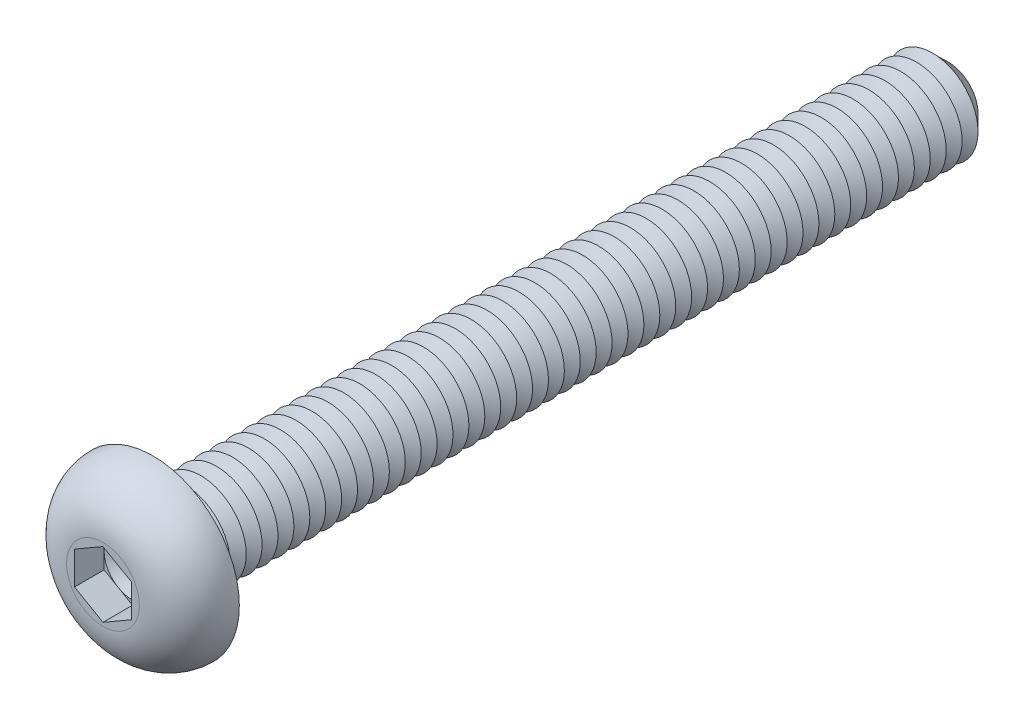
ISO-10303-21;
HEADER;
FILE_DESCRIPTION(('STEP AP214'),'2;1');
FILE_NAME('part.step','',(''),(''),'','','');
FILE_SCHEMA(('AUTOMOTIVE_DESIGN { 1 0 10303 214 1 1 1 1 }'));
ENDSEC;
DATA;
#1=APPLICATION_CONTEXT('core data for automotive mechanical design processes');
#2=APPLICATION_PROTOCOL_DEFINITION('international standard','automotive_design',2000,#1);
#3=PRODUCT_CONTEXT('',#1,'mechanical');
#4=PRODUCT('Part','Part','',(#3));
#5=PRODUCT_RELATED_PRODUCT_CATEGORY('part','',(#4));
#6=PRODUCT_DEFINITION_FORMATION('','',#4);
#7=PRODUCT_DEFINITION_CONTEXT('part definition',#1,'design');
#8=PRODUCT_DEFINITION('design','',#6,#7);
#9=PRODUCT_DEFINITION_SHAPE('','',#8);
#10=(LENGTH_UNIT() NAMED_UNIT(*) SI_UNIT(.MILLI.,.METRE.));
#11=(NAMED_UNIT(*) PLANE_ANGLE_UNIT() SI_UNIT($,.RADIAN.));
#12=(NAMED_UNIT(*) SI_UNIT($,.STERADIAN.) SOLID_ANGLE_UNIT());
#13=UNCERTAINTY_MEASURE_WITH_UNIT(LENGTH_MEASURE(1.E-05),#10,'distance_accuracy_value','');
#14=(GEOMETRIC_REPRESENTATION_CONTEXT(3) GLOBAL_UNCERTAINTY_ASSIGNED_CONTEXT((#13)) GLOBAL_UNIT_ASSIGNED_CONTEXT((#10,
#11,#12)) REPRESENTATION_CONTEXT('',''));
#15=CARTESIAN_POINT('',(0.,0.,0.));
#16=DIRECTION('',(0.,0.,1.));
#17=DIRECTION('',(1.,0.,0.));
#18=AXIS2_PLACEMENT_3D('',#15,#16,#17);
#19=CARTESIAN_POINT('',(0.,0.,0.900000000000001));
#20=DIRECTION('',(0.,0.,1.));
#21=DIRECTION('',(1.,0.,0.));
#22=AXIS2_PLACEMENT_3D('',#19,#20,#21);
#23=PLANE('',#22);
#24=CARTESIAN_POINT('',(0.,0.,0.900000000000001));
#25=DIRECTION('',(0.,0.,1.));
#26=DIRECTION('',(1.,0.,0.));
#27=AXIS2_PLACEMENT_3D('',#24,#25,#26);
#28=CIRCLE('',#27,1.25);
#29=CARTESIAN_POINT('',(1.25,0.,0.900000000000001));
#30=VERTEX_POINT('',#29);
#31=CARTESIAN_POINT('',(0.625,1.08253175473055,0.900000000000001));
#32=VERTEX_POINT('',#31);
#33=EDGE_CURVE('E117',#30,#32,#28,.T.);
#34=ORIENTED_EDGE('',*,*,#33,.F.);
#35=DIRECTION('',(0.,1.,0.));
#36=VECTOR('',#35,1.);
#37=CARTESIAN_POINT('',(1.25,-0.721687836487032,0.900000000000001));
#38=LINE('',#37,#36);
#39=CARTESIAN_POINT('',(1.25,0.721687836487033,0.900000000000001));
#40=VERTEX_POINT('',#39);
#41=EDGE_CURVE('E140',#30,#40,#38,.T.);
#42=ORIENTED_EDGE('',*,*,#41,.T.);
#43=DIRECTION('',(-0.866025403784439,0.5,0.));
#44=VECTOR('',#43,1.);
#45=CARTESIAN_POINT('',(1.25,0.721687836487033,0.900000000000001));
#46=LINE('',#45,#44);
#47=EDGE_CURVE('E135',#40,#32,#46,.T.);
#48=ORIENTED_EDGE('',*,*,#47,.T.);
#49=EDGE_LOOP('',(#34,#42,#48));
#50=FACE_BOUND('',#49,.T.);
#51=ADVANCED_FACE('F39',(#50),#23,.T.);
#52=CARTESIAN_POINT('',(0.,0.,0.900000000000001));
#53=DIRECTION('',(0.,0.,1.));
#54=DIRECTION('',(1.,0.,0.));
#55=AXIS2_PLACEMENT_3D('',#52,#53,#54);
#56=CIRCLE('',#55,1.25);
#57=CARTESIAN_POINT('',(-0.625,1.08253175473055,0.900000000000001));
#58=VERTEX_POINT('',#57);
#59=EDGE_CURVE('E11',#32,#58,#56,.T.);
#60=ORIENTED_EDGE('',*,*,#59,.F.);
#61=CARTESIAN_POINT('',(0.,1.44337567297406,0.900000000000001));
#62=VERTEX_POINT('',#61);
#63=EDGE_CURVE('E130',#32,#62,#46,.T.);
#64=ORIENTED_EDGE('',*,*,#63,.T.);
#65=DIRECTION('',(-0.866025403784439,-0.5,0.));
#66=VECTOR('',#65,1.);
#67=CARTESIAN_POINT('',(0.,1.44337567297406,0.900000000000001));
#68=LINE('',#67,#66);
#69=EDGE_CURVE('E132',#62,#58,#68,.T.);
#70=ORIENTED_EDGE('',*,*,#69,.T.);
#71=EDGE_LOOP('',(#60,#64,#70));
#72=FACE_BOUND('',#71,.T.);
#73=ADVANCED_FACE('F129',(#72),#23,.T.);
#74=CARTESIAN_POINT('',(-1.25,0.,0.900000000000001));
#75=VERTEX_POINT('',#74);
#76=EDGE_CURVE('E49',#58,#75,#56,.T.);
#77=ORIENTED_EDGE('',*,*,#76,.F.);
#78=CARTESIAN_POINT('',(-1.25,0.721687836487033,0.900000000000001));
#79=VERTEX_POINT('',#78);
#80=EDGE_CURVE('E143',#58,#79,#68,.T.);
#81=ORIENTED_EDGE('',*,*,#80,.T.);
#82=DIRECTION('',(0.,-1.,0.));
#83=VECTOR('',#82,1.);
#84=CARTESIAN_POINT('',(-1.25,0.721687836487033,0.900000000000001));
#85=LINE('',#84,#83);
#86=EDGE_CURVE('E153',#79,#75,#85,.T.);
#87=ORIENTED_EDGE('',*,*,#86,.T.);
#88=EDGE_LOOP('',(#77,#81,#87));
#89=FACE_BOUND('',#88,.T.);
#90=ADVANCED_FACE('F250',(#89),#23,.T.);
#91=CARTESIAN_POINT('',(-0.625,-1.08253175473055,0.900000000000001));
#92=VERTEX_POINT('',#91);
#93=EDGE_CURVE('E232',#75,#92,#56,.T.);
#94=ORIENTED_EDGE('',*,*,#93,.F.);
#95=CARTESIAN_POINT('',(-1.25,-0.721687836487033,0.900000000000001));
#96=VERTEX_POINT('',#95);
#97=EDGE_CURVE('E152',#75,#96,#85,.T.);
#98=ORIENTED_EDGE('',*,*,#97,.T.);
#99=DIRECTION('',(0.866025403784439,-0.5,0.));
#100=VECTOR('',#99,1.);
#101=CARTESIAN_POINT('',(-1.25,-0.721687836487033,0.900000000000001));
#102=LINE('',#101,#100);
#103=EDGE_CURVE('E158',#96,#92,#102,.T.);
#104=ORIENTED_EDGE('',*,*,#103,.T.);
#105=EDGE_LOOP('',(#94,#98,#104));
#106=FACE_BOUND('',#105,.T.);
#107=ADVANCED_FACE('F243',(#106),#23,.T.);
#108=CARTESIAN_POINT('',(0.625,-1.08253175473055,0.900000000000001));
#109=VERTEX_POINT('',#108);
#110=EDGE_CURVE('E56',#92,#109,#56,.T.);
#111=ORIENTED_EDGE('',*,*,#110,.F.);
#112=CARTESIAN_POINT('',(0.,-1.44337567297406,0.900000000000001));
#113=VERTEX_POINT('',#112);
#114=EDGE_CURVE('E157',#92,#113,#102,.T.);
#115=ORIENTED_EDGE('',*,*,#114,.T.);
#116=DIRECTION('',(0.866025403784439,0.5,0.));
#117=VECTOR('',#116,1.);
#118=CARTESIAN_POINT('',(0.,-1.44337567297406,0.900000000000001));
#119=LINE('',#118,#117);
#120=EDGE_CURVE('E163',#113,#109,#119,.T.);
#121=ORIENTED_EDGE('',*,*,#120,.T.);
#122=EDGE_LOOP('',(#111,#115,#121));
#123=FACE_BOUND('',#122,.T.);
#124=ADVANCED_FACE('F442',(#123),#23,.T.);
#125=CARTESIAN_POINT('',(0.,0.,-35.));
#126=DIRECTION('',(0.,0.,1.));
#127=DIRECTION('',(1.,0.,0.));
#128=AXIS2_PLACEMENT_3D('',#125,#126,#127);
#129=CYLINDRICAL_SURFACE('',#128,2.);
#130=CARTESIAN_POINT('',(0.,0.,-0.300000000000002));
#131=DIRECTION('',(0.,0.,1.));
#132=DIRECTION('',(1.,0.,0.));
#133=AXIS2_PLACEMENT_3D('',#130,#131,#132);
#134=CIRCLE('',#133,2.);
#135=CARTESIAN_POINT('',(2.,0.,-0.300000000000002));
#136=VERTEX_POINT('',#135);
#137=EDGE_CURVE('E221',#136,#136,#134,.F.);
#138=ORIENTED_EDGE('',*,*,#137,.T.);
#139=EDGE_LOOP('',(#138));
#140=FACE_BOUND('',#139,.T.);
#141=CARTESIAN_POINT('',(0.,0.,-0.699999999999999));
#142=DIRECTION('',(0.,0.,1.));
#143=DIRECTION('',(1.,0.,0.));
#144=AXIS2_PLACEMENT_3D('',#141,#142,#143);
#145=CIRCLE('',#144,2.);
#146=CARTESIAN_POINT('',(2.,0.,-0.699999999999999));
#147=VERTEX_POINT('',#146);
#148=EDGE_CURVE('E148',#147,#147,#145,.T.);
#149=ORIENTED_EDGE('',*,*,#148,.T.);
#150=EDGE_LOOP('',(#149));
#151=FACE_BOUND('',#150,.T.);
#152=ADVANCED_FACE('F428',(#140,#151),#129,.T.);
#153=CARTESIAN_POINT('',(0.,3.8,0.));
#154=DIRECTION('',(0.,0.,1.));
#155=DIRECTION('',(1.,0.,0.));
#156=AXIS2_PLACEMENT_3D('',#153,#154,#155);
#157=PLANE('',#156);
#158=CARTESIAN_POINT('',(0.,0.,0.));
#159=DIRECTION('',(0.,0.,1.));
#160=DIRECTION('',(1.,0.,0.));
#161=AXIS2_PLACEMENT_3D('',#158,#159,#160);
#162=CIRCLE('',#161,2.3);
#163=CARTESIAN_POINT('',(2.3,0.,0.));
#164=VERTEX_POINT('',#163);
#165=EDGE_CURVE('E224',#164,#164,#162,.T.);
#166=ORIENTED_EDGE('',*,*,#165,.T.);
#167=EDGE_LOOP('',(#166));
#168=FACE_BOUND('',#167,.T.);
#169=CARTESIAN_POINT('',(0.,0.,0.));
#170=DIRECTION('',(0.,0.,1.));
#171=DIRECTION('',(1.,0.,0.));
#172=AXIS2_PLACEMENT_3D('',#169,#170,#171);
#173=CIRCLE('',#172,3.8);
#174=CARTESIAN_POINT('',(3.8,0.,0.));
#175=VERTEX_POINT('',#174);
#176=EDGE_CURVE('E195',#175,#175,#173,.T.);
#177=ORIENTED_EDGE('',*,*,#176,.F.);
#178=EDGE_LOOP('',(#177));
#179=FACE_BOUND('',#178,.T.);
#180=ADVANCED_FACE('F468',(#168,#179),#157,.F.);
#181=CARTESIAN_POINT('',(0.,0.,2.2));
#182=DIRECTION('',(0.,0.,-1.));
#183=DIRECTION('',(-1.,0.,0.));
#184=AXIS2_PLACEMENT_3D('',#181,#182,#183);
#185=PLANE('',#184);
#186=DIRECTION('',(-0.866025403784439,-0.5,0.));
#187=VECTOR('',#186,1.);
#188=CARTESIAN_POINT('',(0.,1.44337567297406,2.2));
#189=LINE('',#188,#187);
#190=CARTESIAN_POINT('',(0.,1.44337567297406,2.2));
#191=VERTEX_POINT('',#190);
#192=CARTESIAN_POINT('',(-1.25,0.721687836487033,2.2));
#193=VERTEX_POINT('',#192);
#194=EDGE_CURVE('E173',#191,#193,#189,.T.);
#195=ORIENTED_EDGE('',*,*,#194,.F.);
#196=DIRECTION('',(-0.866025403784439,0.5,0.));
#197=VECTOR('',#196,1.);
#198=CARTESIAN_POINT('',(1.25,0.721687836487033,2.2));
#199=LINE('',#198,#197);
#200=CARTESIAN_POINT('',(1.25,0.721687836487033,2.2));
#201=VERTEX_POINT('',#200);
#202=EDGE_CURVE('E64',#201,#191,#199,.T.);
#203=ORIENTED_EDGE('',*,*,#202,.F.);
#204=DIRECTION('',(0.,1.,0.));
#205=VECTOR('',#204,1.);
#206=CARTESIAN_POINT('',(1.25,-0.721687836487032,2.2));
#207=LINE('',#206,#205);
#208=CARTESIAN_POINT('',(1.25,-0.721687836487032,2.2));
#209=VERTEX_POINT('',#208);
#210=EDGE_CURVE('E138',#209,#201,#207,.T.);
#211=ORIENTED_EDGE('',*,*,#210,.F.);
#212=DIRECTION('',(0.866025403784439,0.5,0.));
#213=VECTOR('',#212,1.);
#214=CARTESIAN_POINT('',(0.,-1.44337567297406,2.2));
#215=LINE('',#214,#213);
#216=CARTESIAN_POINT('',(0.,-1.44337567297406,2.2));
#217=VERTEX_POINT('',#216);
#218=EDGE_CURVE('E185',#217,#209,#215,.T.);
#219=ORIENTED_EDGE('',*,*,#218,.F.);
#220=DIRECTION('',(0.866025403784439,-0.5,0.));
#221=VECTOR('',#220,1.);
#222=CARTESIAN_POINT('',(-1.25,-0.721687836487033,2.2));
#223=LINE('',#222,#221);
#224=CARTESIAN_POINT('',(-1.25,-0.721687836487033,2.2));
#225=VERTEX_POINT('',#224);
#226=EDGE_CURVE('E181',#225,#217,#223,.T.);
#227=ORIENTED_EDGE('',*,*,#226,.F.);
#228=DIRECTION('',(0.,-1.,0.));
#229=VECTOR('',#228,1.);
#230=CARTESIAN_POINT('',(-1.25,0.721687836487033,2.2));
#231=LINE('',#230,#229);
#232=EDGE_CURVE('E177',#193,#225,#231,.T.);
#233=ORIENTED_EDGE('',*,*,#232,.F.);
#234=EDGE_LOOP('',(#195,#203,#211,#219,#227,#233));
#235=FACE_BOUND('',#234,.T.);
#236=CARTESIAN_POINT('',(0.,0.,2.2));
#237=DIRECTION('',(0.,0.,1.));
#238=DIRECTION('',(1.,0.,0.));
#239=AXIS2_PLACEMENT_3D('',#236,#237,#238);
#240=CIRCLE('',#239,1.6);
#241=CARTESIAN_POINT('',(1.6,0.,2.2));
#242=VERTEX_POINT('',#241);
#243=EDGE_CURVE('E213',#242,#242,#240,.T.);
#244=ORIENTED_EDGE('',*,*,#243,.T.);
#245=EDGE_LOOP('',(#244));
#246=FACE_BOUND('',#245,.T.);
#247=ADVANCED_FACE('F259',(#235,#246),#185,.F.);
#248=CARTESIAN_POINT('',(0.,0.,0.));
#249=DIRECTION('',(0.,0.,1.));
#250=DIRECTION('',(1.,0.,0.));
#251=AXIS2_PLACEMENT_3D('',#248,#249,#250);
#252=DEGENERATE_TOROIDAL_SURFACE('',#251,1.6,2.2,.T.);
#253=ORIENTED_EDGE('',*,*,#243,.F.);
#254=EDGE_LOOP('',(#253));
#255=FACE_BOUND('',#254,.T.);
#256=ORIENTED_EDGE('',*,*,#176,.T.);
#257=EDGE_LOOP('',(#256));
#258=FACE_BOUND('',#257,.T.);
#259=ADVANCED_FACE('F462',(#255,#258),#252,.T.);
#260=CARTESIAN_POINT('',(1.25,0.721687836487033,0.900000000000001));
#261=DIRECTION('',(0.5,0.866025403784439,0.));
#262=DIRECTION('',(-0.866025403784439,0.5,0.));
#263=AXIS2_PLACEMENT_3D('',#260,#261,#262);
#264=PLANE('',#263);
#265=ORIENTED_EDGE('',*,*,#202,.T.);
#266=DIRECTION('',(0.,0.,1.));
#267=VECTOR('',#266,1.);
#268=CARTESIAN_POINT('',(0.,1.44337567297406,0.900000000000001));
#269=LINE('',#268,#267);
#270=EDGE_CURVE('E136',#62,#191,#269,.T.);
#271=ORIENTED_EDGE('',*,*,#270,.F.);
#272=ORIENTED_EDGE('',*,*,#63,.F.);
#273=ORIENTED_EDGE('',*,*,#47,.F.);
#274=DIRECTION('',(0.,0.,1.));
#275=VECTOR('',#274,1.);
#276=CARTESIAN_POINT('',(1.25,0.721687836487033,0.900000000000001));
#277=LINE('',#276,#275);
#278=EDGE_CURVE('E192',#40,#201,#277,.T.);
#279=ORIENTED_EDGE('',*,*,#278,.T.);
#280=EDGE_LOOP('',(#265,#271,#272,#273,#279));
#281=FACE_BOUND('',#280,.T.);
#282=ADVANCED_FACE('F134',(#281),#264,.F.);
#283=CARTESIAN_POINT('',(1.25,-0.721687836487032,0.900000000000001));
#284=DIRECTION('',(1.,0.,0.));
#285=DIRECTION('',(0.,1.,0.));
#286=AXIS2_PLACEMENT_3D('',#283,#284,#285);
#287=PLANE('',#286);
#288=ORIENTED_EDGE('',*,*,#210,.T.);
#289=ORIENTED_EDGE('',*,*,#278,.F.);
#290=ORIENTED_EDGE('',*,*,#41,.F.);
#291=CARTESIAN_POINT('',(1.25,-0.721687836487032,0.900000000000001));
#292=VERTEX_POINT('',#291);
#293=EDGE_CURVE('E167',#292,#30,#38,.T.);
#294=ORIENTED_EDGE('',*,*,#293,.F.);
#295=DIRECTION('',(0.,0.,1.));
#296=VECTOR('',#295,1.);
#297=CARTESIAN_POINT('',(1.25,-0.721687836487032,0.900000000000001));
#298=LINE('',#297,#296);
#299=EDGE_CURVE('E196',#292,#209,#298,.T.);
#300=ORIENTED_EDGE('',*,*,#299,.T.);
#301=EDGE_LOOP('',(#288,#289,#290,#294,#300));
#302=FACE_BOUND('',#301,.T.);
#303=ADVANCED_FACE('F340',(#302),#287,.F.);
#304=CARTESIAN_POINT('',(0.,-1.44337567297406,0.900000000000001));
#305=DIRECTION('',(0.5,-0.866025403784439,0.));
#306=DIRECTION('',(0.866025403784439,0.5,0.));
#307=AXIS2_PLACEMENT_3D('',#304,#305,#306);
#308=PLANE('',#307);
#309=ORIENTED_EDGE('',*,*,#218,.T.);
#310=ORIENTED_EDGE('',*,*,#299,.F.);
#311=EDGE_CURVE('E162',#109,#292,#119,.T.);
#312=ORIENTED_EDGE('',*,*,#311,.F.);
#313=ORIENTED_EDGE('',*,*,#120,.F.);
#314=DIRECTION('',(0.,0.,1.));
#315=VECTOR('',#314,1.);
#316=CARTESIAN_POINT('',(0.,-1.44337567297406,0.900000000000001));
#317=LINE('',#316,#315);
#318=EDGE_CURVE('E199',#113,#217,#317,.T.);
#319=ORIENTED_EDGE('',*,*,#318,.T.);
#320=EDGE_LOOP('',(#309,#310,#312,#313,#319));
#321=FACE_BOUND('',#320,.T.);
#322=ADVANCED_FACE('F338',(#321),#308,.F.);
#323=CARTESIAN_POINT('',(-1.25,-0.721687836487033,0.900000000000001));
#324=DIRECTION('',(-0.5,-0.866025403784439,0.));
#325=DIRECTION('',(0.866025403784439,-0.5,0.));
#326=AXIS2_PLACEMENT_3D('',#323,#324,#325);
#327=PLANE('',#326);
#328=ORIENTED_EDGE('',*,*,#226,.T.);
#329=ORIENTED_EDGE('',*,*,#318,.F.);
#330=ORIENTED_EDGE('',*,*,#114,.F.);
#331=ORIENTED_EDGE('',*,*,#103,.F.);
#332=DIRECTION('',(0.,0.,1.));
#333=VECTOR('',#332,1.);
#334=CARTESIAN_POINT('',(-1.25,-0.721687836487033,0.900000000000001));
#335=LINE('',#334,#333);
#336=EDGE_CURVE('E202',#96,#225,#335,.T.);
#337=ORIENTED_EDGE('',*,*,#336,.T.);
#338=EDGE_LOOP('',(#328,#329,#330,#331,#337));
#339=FACE_BOUND('',#338,.T.);
#340=ADVANCED_FACE('F264',(#339),#327,.F.);
#341=CARTESIAN_POINT('',(-1.25,0.721687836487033,0.900000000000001));
#342=DIRECTION('',(-1.,0.,0.));
#343=DIRECTION('',(0.,0.,1.));
#344=AXIS2_PLACEMENT_3D('',#341,#342,#343);
#345=PLANE('',#344);
#346=ORIENTED_EDGE('',*,*,#232,.T.);
#347=ORIENTED_EDGE('',*,*,#336,.F.);
#348=ORIENTED_EDGE('',*,*,#97,.F.);
#349=ORIENTED_EDGE('',*,*,#86,.F.);
#350=DIRECTION('',(0.,0.,1.));
#351=VECTOR('',#350,1.);
#352=CARTESIAN_POINT('',(-1.25,0.721687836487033,0.900000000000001));
#353=LINE('',#352,#351);
#354=EDGE_CURVE('E205',#79,#193,#353,.T.);
#355=ORIENTED_EDGE('',*,*,#354,.T.);
#356=EDGE_LOOP('',(#346,#347,#348,#349,#355));
#357=FACE_BOUND('',#356,.T.);
#358=ADVANCED_FACE('F248',(#357),#345,.F.);
#359=CARTESIAN_POINT('',(0.,1.44337567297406,0.900000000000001));
#360=DIRECTION('',(-0.5,0.866025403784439,0.));
#361=DIRECTION('',(-0.866025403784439,-0.5,0.));
#362=AXIS2_PLACEMENT_3D('',#359,#360,#361);
#363=PLANE('',#362);
#364=ORIENTED_EDGE('',*,*,#194,.T.);
#365=ORIENTED_EDGE('',*,*,#354,.F.);
#366=ORIENTED_EDGE('',*,*,#80,.F.);
#367=ORIENTED_EDGE('',*,*,#69,.F.);
#368=ORIENTED_EDGE('',*,*,#270,.T.);
#369=EDGE_LOOP('',(#364,#365,#366,#367,#368));
#370=FACE_BOUND('',#369,.T.);
#371=ADVANCED_FACE('F253',(#370),#363,.F.);
#372=EDGE_CURVE('E43',#109,#30,#56,.T.);
#373=ORIENTED_EDGE('',*,*,#372,.F.);
#374=ORIENTED_EDGE('',*,*,#311,.T.);
#375=ORIENTED_EDGE('',*,*,#293,.T.);
#376=EDGE_LOOP('',(#373,#374,#375));
#377=FACE_BOUND('',#376,.T.);
#378=ADVANCED_FACE('F335',(#377),#23,.T.);
#379=CARTESIAN_POINT('',(0.,0.,-0.699999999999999));
#380=DIRECTION('',(0.,0.,1.));
#381=DIRECTION('',(1.,0.,0.));
#382=AXIS2_PLACEMENT_3D('',#379,#380,#381);
#383=CONICAL_SURFACE('',#382,2.,1.04719755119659);
#384=CARTESIAN_POINT('',(0.,0.,-1.05));
#385=DIRECTION('',(0.,0.,1.));
#386=DIRECTION('',(1.,0.,0.));
#387=AXIS2_PLACEMENT_3D('',#384,#385,#386);
#388=CIRCLE('',#387,1.3937822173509);
#389=CARTESIAN_POINT('',(1.3937822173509,0.,-1.05));
#390=VERTEX_POINT('',#389);
#391=EDGE_CURVE('E418',#390,#390,#388,.T.);
#392=ORIENTED_EDGE('',*,*,#391,.T.);
#393=EDGE_LOOP('',(#392));
#394=FACE_BOUND('',#393,.T.);
#395=ORIENTED_EDGE('',*,*,#148,.F.);
#396=EDGE_LOOP('',(#395));
#397=FACE_BOUND('',#396,.T.);
#398=ADVANCED_FACE('F430',(#394,#397),#383,.T.);
#399=CARTESIAN_POINT('',(0.,0.,-1.05));
#400=DIRECTION('',(0.,0.,-1.));
#401=DIRECTION('',(-1.,0.,0.));
#402=AXIS2_PLACEMENT_3D('',#399,#400,#401);
#403=CONICAL_SURFACE('',#402,1.3937822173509,1.0471975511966);
#404=CARTESIAN_POINT('',(0.,0.,-1.4));
#405=DIRECTION('',(0.,0.,1.));
#406=DIRECTION('',(1.,0.,0.));
#407=AXIS2_PLACEMENT_3D('',#404,#405,#406);
#408=CIRCLE('',#407,2.);
#409=CARTESIAN_POINT('',(2.,0.,-1.4));
#410=VERTEX_POINT('',#409);
#411=EDGE_CURVE('E416',#410,#410,#408,.T.);
#412=ORIENTED_EDGE('',*,*,#411,.T.);
#413=EDGE_LOOP('',(#412));
#414=FACE_BOUND('',#413,.T.);
#415=ORIENTED_EDGE('',*,*,#391,.F.);
#416=EDGE_LOOP('',(#415));
#417=FACE_BOUND('',#416,.T.);
#418=ADVANCED_FACE('F432',(#414,#417),#403,.T.);
#419=CARTESIAN_POINT('',(0.,0.,-1.4));
#420=DIRECTION('',(0.,0.,1.));
#421=DIRECTION('',(1.,0.,0.));
#422=AXIS2_PLACEMENT_3D('',#419,#420,#421);
#423=CONICAL_SURFACE('',#422,2.,1.04719755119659);
#424=CARTESIAN_POINT('',(0.,0.,-1.75));
#425=DIRECTION('',(0.,0.,1.));
#426=DIRECTION('',(1.,0.,0.));
#427=AXIS2_PLACEMENT_3D('',#424,#425,#426);
#428=CIRCLE('',#427,1.3937822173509);
#429=CARTESIAN_POINT('',(1.3937822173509,0.,-1.75));
#430=VERTEX_POINT('',#429);
#431=EDGE_CURVE('E412',#430,#430,#428,.T.);
#432=ORIENTED_EDGE('',*,*,#431,.T.);
#433=EDGE_LOOP('',(#432));
#434=FACE_BOUND('',#433,.T.);
#435=ORIENTED_EDGE('',*,*,#411,.F.);
#436=EDGE_LOOP('',(#435));
#437=FACE_BOUND('',#436,.T.);
#438=ADVANCED_FACE('F438',(#434,#437),#423,.T.);
#439=CARTESIAN_POINT('',(0.,0.,-1.75));
#440=DIRECTION('',(0.,0.,-1.));
#441=DIRECTION('',(-1.,0.,0.));
#442=AXIS2_PLACEMENT_3D('',#439,#440,#441);
#443=CONICAL_SURFACE('',#442,1.3937822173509,1.0471975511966);
#444=CARTESIAN_POINT('',(0.,0.,-2.1));
#445=DIRECTION('',(0.,0.,1.));
#446=DIRECTION('',(1.,0.,0.));
#447=AXIS2_PLACEMENT_3D('',#444,#445,#446);
#448=CIRCLE('',#447,2.);
#449=CARTESIAN_POINT('',(2.,0.,-2.1));
#450=VERTEX_POINT('',#449);
#451=EDGE_CURVE('E303',#450,#450,#448,.T.);
#452=ORIENTED_EDGE('',*,*,#451,.T.);
#453=EDGE_LOOP('',(#452));
#454=FACE_BOUND('',#453,.T.);
#455=ORIENTED_EDGE('',*,*,#431,.F.);
#456=EDGE_LOOP('',(#455));
#457=FACE_BOUND('',#456,.T.);
#458=ADVANCED_FACE('F758',(#454,#457),#443,.T.);
#459=CARTESIAN_POINT('',(0.,0.,-2.1));
#460=DIRECTION('',(0.,0.,1.));
#461=DIRECTION('',(1.,0.,0.));
#462=AXIS2_PLACEMENT_3D('',#459,#460,#461);
#463=CONICAL_SURFACE('',#462,2.,1.04719755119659);
#464=CARTESIAN_POINT('',(0.,0.,-2.45));
#465=DIRECTION('',(0.,0.,1.));
#466=DIRECTION('',(1.,0.,0.));
#467=AXIS2_PLACEMENT_3D('',#464,#465,#466);
#468=CIRCLE('',#467,1.3937822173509);
#469=CARTESIAN_POINT('',(1.3937822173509,0.,-2.45));
#470=VERTEX_POINT('',#469);
#471=EDGE_CURVE('E301',#470,#470,#468,.T.);
#472=ORIENTED_EDGE('',*,*,#471,.T.);
#473=EDGE_LOOP('',(#472));
#474=FACE_BOUND('',#473,.T.);
#475=ORIENTED_EDGE('',*,*,#451,.F.);
#476=EDGE_LOOP('',(#475));
#477=FACE_BOUND('',#476,.T.);
#478=ADVANCED_FACE('F755',(#474,#477),#463,.T.);
#479=CARTESIAN_POINT('',(0.,0.,-2.45));
#480=DIRECTION('',(0.,0.,-1.));
#481=DIRECTION('',(-1.,0.,0.));
#482=AXIS2_PLACEMENT_3D('',#479,#480,#481);
#483=CONICAL_SURFACE('',#482,1.3937822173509,1.0471975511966);
#484=CARTESIAN_POINT('',(0.,0.,-2.8));
#485=DIRECTION('',(0.,0.,1.));
#486=DIRECTION('',(1.,0.,0.));
#487=AXIS2_PLACEMENT_3D('',#484,#485,#486);
#488=CIRCLE('',#487,2.);
#489=CARTESIAN_POINT('',(2.,0.,-2.8));
#490=VERTEX_POINT('',#489);
#491=EDGE_CURVE('E304',#490,#490,#488,.T.);
#492=ORIENTED_EDGE('',*,*,#491,.T.);
#493=EDGE_LOOP('',(#492));
#494=FACE_BOUND('',#493,.T.);
#495=ORIENTED_EDGE('',*,*,#471,.F.);
#496=EDGE_LOOP('',(#495));
#497=FACE_BOUND('',#496,.T.);
#498=ADVANCED_FACE('F751',(#494,#497),#483,.T.);
#499=CARTESIAN_POINT('',(0.,0.,-2.8));
#500=DIRECTION('',(0.,0.,1.));
#501=DIRECTION('',(1.,0.,0.));
#502=AXIS2_PLACEMENT_3D('',#499,#500,#501);
#503=CONICAL_SURFACE('',#502,2.,1.04719755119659);
#504=CARTESIAN_POINT('',(0.,0.,-3.15));
#505=DIRECTION('',(0.,0.,1.));
#506=DIRECTION('',(1.,0.,0.));
#507=AXIS2_PLACEMENT_3D('',#504,#505,#506);
#508=CIRCLE('',#507,1.3937822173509);
#509=CARTESIAN_POINT('',(1.3937822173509,0.,-3.15));
#510=VERTEX_POINT('',#509);
#511=EDGE_CURVE('E399',#510,#510,#508,.T.);
#512=ORIENTED_EDGE('',*,*,#511,.T.);
#513=EDGE_LOOP('',(#512));
#514=FACE_BOUND('',#513,.T.);
#515=ORIENTED_EDGE('',*,*,#491,.F.);
#516=EDGE_LOOP('',(#515));
#517=FACE_BOUND('',#516,.T.);
#518=ADVANCED_FACE('F745',(#514,#517),#503,.T.);
#519=CARTESIAN_POINT('',(0.,0.,-3.15));
#520=DIRECTION('',(0.,0.,-1.));
#521=DIRECTION('',(-1.,0.,0.));
#522=AXIS2_PLACEMENT_3D('',#519,#520,#521);
#523=CONICAL_SURFACE('',#522,1.3937822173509,1.0471975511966);
#524=CARTESIAN_POINT('',(0.,0.,-3.5));
#525=DIRECTION('',(0.,0.,1.));
#526=DIRECTION('',(1.,0.,0.));
#527=AXIS2_PLACEMENT_3D('',#524,#525,#526);
#528=CIRCLE('',#527,2.);
#529=CARTESIAN_POINT('',(2.,0.,-3.5));
#530=VERTEX_POINT('',#529);
#531=EDGE_CURVE('E405',#530,#530,#528,.T.);
#532=ORIENTED_EDGE('',*,*,#531,.T.);
#533=EDGE_LOOP('',(#532));
#534=FACE_BOUND('',#533,.T.);
#535=ORIENTED_EDGE('',*,*,#511,.F.);
#536=EDGE_LOOP('',(#535));
#537=FACE_BOUND('',#536,.T.);
#538=ADVANCED_FACE('F730',(#534,#537),#523,.T.);
#539=CARTESIAN_POINT('',(0.,0.,-3.5));
#540=DIRECTION('',(0.,0.,1.));
#541=DIRECTION('',(1.,0.,0.));
#542=AXIS2_PLACEMENT_3D('',#539,#540,#541);
#543=CONICAL_SURFACE('',#542,2.,1.04719755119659);
#544=CARTESIAN_POINT('',(0.,0.,-3.85));
#545=DIRECTION('',(0.,0.,1.));
#546=DIRECTION('',(1.,0.,0.));
#547=AXIS2_PLACEMENT_3D('',#544,#545,#546);
#548=CIRCLE('',#547,1.3937822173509);
#549=CARTESIAN_POINT('',(1.3937822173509,0.,-3.85));
#550=VERTEX_POINT('',#549);
#551=EDGE_CURVE('E724',#550,#550,#548,.T.);
#552=ORIENTED_EDGE('',*,*,#551,.T.);
#553=EDGE_LOOP('',(#552));
#554=FACE_BOUND('',#553,.T.);
#555=ORIENTED_EDGE('',*,*,#531,.F.);
#556=EDGE_LOOP('',(#555));
#557=FACE_BOUND('',#556,.T.);
#558=ADVANCED_FACE('F733',(#554,#557),#543,.T.);
#559=CARTESIAN_POINT('',(0.,0.,-3.85));
#560=DIRECTION('',(0.,0.,-1.));
#561=DIRECTION('',(-1.,0.,0.));
#562=AXIS2_PLACEMENT_3D('',#559,#560,#561);
#563=CONICAL_SURFACE('',#562,1.3937822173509,1.0471975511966);
#564=CARTESIAN_POINT('',(0.,0.,-4.2));
#565=DIRECTION('',(0.,0.,1.));
#566=DIRECTION('',(1.,0.,0.));
#567=AXIS2_PLACEMENT_3D('',#564,#565,#566);
#568=CIRCLE('',#567,2.);
#569=CARTESIAN_POINT('',(2.,0.,-4.2));
#570=VERTEX_POINT('',#569);
#571=EDGE_CURVE('E720',#570,#570,#568,.T.);
#572=ORIENTED_EDGE('',*,*,#571,.T.);
#573=EDGE_LOOP('',(#572));
#574=FACE_BOUND('',#573,.T.);
#575=ORIENTED_EDGE('',*,*,#551,.F.);
#576=EDGE_LOOP('',(#575));
#577=FACE_BOUND('',#576,.T.);
#578=ADVANCED_FACE('F735',(#574,#577),#563,.T.);
#579=CARTESIAN_POINT('',(0.,0.,-4.2));
#580=DIRECTION('',(0.,0.,1.));
#581=DIRECTION('',(1.,0.,0.));
#582=AXIS2_PLACEMENT_3D('',#579,#580,#581);
#583=CONICAL_SURFACE('',#582,2.,1.04719755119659);
#584=CARTESIAN_POINT('',(0.,0.,-4.55));
#585=DIRECTION('',(0.,0.,1.));
#586=DIRECTION('',(1.,0.,0.));
#587=AXIS2_PLACEMENT_3D('',#584,#585,#586);
#588=CIRCLE('',#587,1.3937822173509);
#589=CARTESIAN_POINT('',(1.3937822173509,0.,-4.55));
#590=VERTEX_POINT('',#589);
#591=EDGE_CURVE('E716',#590,#590,#588,.T.);
#592=ORIENTED_EDGE('',*,*,#591,.T.);
#593=EDGE_LOOP('',(#592));
#594=FACE_BOUND('',#593,.T.);
#595=ORIENTED_EDGE('',*,*,#571,.F.);
#596=EDGE_LOOP('',(#595));
#597=FACE_BOUND('',#596,.T.);
#598=ADVANCED_FACE('F742',(#594,#597),#583,.T.);
#599=CARTESIAN_POINT('',(0.,0.,-4.55));
#600=DIRECTION('',(0.,0.,-1.));
#601=DIRECTION('',(-1.,0.,0.));
#602=AXIS2_PLACEMENT_3D('',#599,#600,#601);
#603=CONICAL_SURFACE('',#602,1.3937822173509,1.0471975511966);
#604=CARTESIAN_POINT('',(0.,0.,-4.9));
#605=DIRECTION('',(0.,0.,1.));
#606=DIRECTION('',(1.,0.,0.));
#607=AXIS2_PLACEMENT_3D('',#604,#605,#606);
#608=CIRCLE('',#607,2.);
#609=CARTESIAN_POINT('',(2.,0.,-4.9));
#610=VERTEX_POINT('',#609);
#611=EDGE_CURVE('E712',#610,#610,#608,.T.);
#612=ORIENTED_EDGE('',*,*,#611,.T.);
#613=EDGE_LOOP('',(#612));
#614=FACE_BOUND('',#613,.T.);
#615=ORIENTED_EDGE('',*,*,#591,.F.);
#616=EDGE_LOOP('',(#615));
#617=FACE_BOUND('',#616,.T.);
#618=ADVANCED_FACE('F804',(#614,#617),#603,.T.);
#619=CARTESIAN_POINT('',(0.,0.,-4.9));
#620=DIRECTION('',(0.,0.,1.));
#621=DIRECTION('',(1.,0.,0.));
#622=AXIS2_PLACEMENT_3D('',#619,#620,#621);
#623=CONICAL_SURFACE('',#622,2.,1.04719755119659);
#624=CARTESIAN_POINT('',(0.,0.,-5.25));
#625=DIRECTION('',(0.,0.,1.));
#626=DIRECTION('',(1.,0.,0.));
#627=AXIS2_PLACEMENT_3D('',#624,#625,#626);
#628=CIRCLE('',#627,1.3937822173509);
#629=CARTESIAN_POINT('',(1.3937822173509,0.,-5.25));
#630=VERTEX_POINT('',#629);
#631=EDGE_CURVE('E370',#630,#630,#628,.T.);
#632=ORIENTED_EDGE('',*,*,#631,.T.);
#633=EDGE_LOOP('',(#632));
#634=FACE_BOUND('',#633,.T.);
#635=ORIENTED_EDGE('',*,*,#611,.F.);
#636=EDGE_LOOP('',(#635));
#637=FACE_BOUND('',#636,.T.);
#638=ADVANCED_FACE('F812',(#634,#637),#623,.T.);
#639=CARTESIAN_POINT('',(0.,0.,-5.25));
#640=DIRECTION('',(0.,0.,-1.));
#641=DIRECTION('',(-1.,0.,0.));
#642=AXIS2_PLACEMENT_3D('',#639,#640,#641);
#643=CONICAL_SURFACE('',#642,1.3937822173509,1.0471975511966);
#644=CARTESIAN_POINT('',(0.,0.,-5.6));
#645=DIRECTION('',(0.,0.,1.));
#646=DIRECTION('',(1.,0.,0.));
#647=AXIS2_PLACEMENT_3D('',#644,#645,#646);
#648=CIRCLE('',#647,2.);
#649=CARTESIAN_POINT('',(2.,0.,-5.6));
#650=VERTEX_POINT('',#649);
#651=EDGE_CURVE('E368',#650,#650,#648,.T.);
#652=ORIENTED_EDGE('',*,*,#651,.T.);
#653=EDGE_LOOP('',(#652));
#654=FACE_BOUND('',#653,.T.);
#655=ORIENTED_EDGE('',*,*,#631,.F.);
#656=EDGE_LOOP('',(#655));
#657=FACE_BOUND('',#656,.T.);
#658=ADVANCED_FACE('F821',(#654,#657),#643,.T.);
#659=CARTESIAN_POINT('',(0.,0.,-5.6));
#660=DIRECTION('',(0.,0.,1.));
#661=DIRECTION('',(1.,0.,0.));
#662=AXIS2_PLACEMENT_3D('',#659,#660,#661);
#663=CONICAL_SURFACE('',#662,2.,1.04719755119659);
#664=CARTESIAN_POINT('',(0.,0.,-5.95));
#665=DIRECTION('',(0.,0.,1.));
#666=DIRECTION('',(1.,0.,0.));
#667=AXIS2_PLACEMENT_3D('',#664,#665,#666);
#668=CIRCLE('',#667,1.3937822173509);
#669=CARTESIAN_POINT('',(1.3937822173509,0.,-5.95));
#670=VERTEX_POINT('',#669);
#671=EDGE_CURVE('E298',#670,#670,#668,.T.);
#672=ORIENTED_EDGE('',*,*,#671,.T.);
#673=EDGE_LOOP('',(#672));
#674=FACE_BOUND('',#673,.T.);
#675=ORIENTED_EDGE('',*,*,#651,.F.);
#676=EDGE_LOOP('',(#675));
#677=FACE_BOUND('',#676,.T.);
#678=ADVANCED_FACE('F830',(#674,#677),#663,.T.);
#679=CARTESIAN_POINT('',(0.,0.,-5.95));
#680=DIRECTION('',(0.,0.,-1.));
#681=DIRECTION('',(-1.,0.,0.));
#682=AXIS2_PLACEMENT_3D('',#679,#680,#681);
#683=CONICAL_SURFACE('',#682,1.3937822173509,1.0471975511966);
#684=CARTESIAN_POINT('',(0.,0.,-6.3));
#685=DIRECTION('',(0.,0.,1.));
#686=DIRECTION('',(1.,0.,0.));
#687=AXIS2_PLACEMENT_3D('',#684,#685,#686);
#688=CIRCLE('',#687,2.);
#689=CARTESIAN_POINT('',(2.,0.,-6.3));
#690=VERTEX_POINT('',#689);
#691=EDGE_CURVE('E295',#690,#690,#688,.T.);
#692=ORIENTED_EDGE('',*,*,#691,.T.);
#693=EDGE_LOOP('',(#692));
#694=FACE_BOUND('',#693,.T.);
#695=ORIENTED_EDGE('',*,*,#671,.F.);
#696=EDGE_LOOP('',(#695));
#697=FACE_BOUND('',#696,.T.);
#698=ADVANCED_FACE('F839',(#694,#697),#683,.T.);
#699=CARTESIAN_POINT('',(0.,0.,-6.3));
#700=DIRECTION('',(0.,0.,1.));
#701=DIRECTION('',(1.,0.,0.));
#702=AXIS2_PLACEMENT_3D('',#699,#700,#701);
#703=CONICAL_SURFACE('',#702,2.,1.04719755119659);
#704=CARTESIAN_POINT('',(0.,0.,-6.65));
#705=DIRECTION('',(0.,0.,1.));
#706=DIRECTION('',(1.,0.,0.));
#707=AXIS2_PLACEMENT_3D('',#704,#705,#706);
#708=CIRCLE('',#707,1.3937822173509);
#709=CARTESIAN_POINT('',(1.3937822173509,0.,-6.65));
#710=VERTEX_POINT('',#709);
#711=EDGE_CURVE('E299',#710,#710,#708,.T.);
#712=ORIENTED_EDGE('',*,*,#711,.T.);
#713=EDGE_LOOP('',(#712));
#714=FACE_BOUND('',#713,.T.);
#715=ORIENTED_EDGE('',*,*,#691,.F.);
#716=EDGE_LOOP('',(#715));
#717=FACE_BOUND('',#716,.T.);
#718=ADVANCED_FACE('F848',(#714,#717),#703,.T.);
#719=CARTESIAN_POINT('',(0.,0.,-6.65));
#720=DIRECTION('',(0.,0.,-1.));
#721=DIRECTION('',(-1.,0.,0.));
#722=AXIS2_PLACEMENT_3D('',#719,#720,#721);
#723=CONICAL_SURFACE('',#722,1.3937822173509,1.0471975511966);
#724=CARTESIAN_POINT('',(0.,0.,-7.));
#725=DIRECTION('',(0.,0.,1.));
#726=DIRECTION('',(1.,0.,0.));
#727=AXIS2_PLACEMENT_3D('',#724,#725,#726);
#728=CIRCLE('',#727,2.);
#729=CARTESIAN_POINT('',(2.,0.,-7.));
#730=VERTEX_POINT('',#729);
#731=EDGE_CURVE('E700',#730,#730,#728,.T.);
#732=ORIENTED_EDGE('',*,*,#731,.T.);
#733=EDGE_LOOP('',(#732));
#734=FACE_BOUND('',#733,.T.);
#735=ORIENTED_EDGE('',*,*,#711,.F.);
#736=EDGE_LOOP('',(#735));
#737=FACE_BOUND('',#736,.T.);
#738=ADVANCED_FACE('F857',(#734,#737),#723,.T.);
#739=CARTESIAN_POINT('',(0.,0.,-7.));
#740=DIRECTION('',(0.,0.,1.));
#741=DIRECTION('',(1.,0.,0.));
#742=AXIS2_PLACEMENT_3D('',#739,#740,#741);
#743=CONICAL_SURFACE('',#742,2.,1.04719755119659);
#744=CARTESIAN_POINT('',(0.,0.,-7.35));
#745=DIRECTION('',(0.,0.,1.));
#746=DIRECTION('',(1.,0.,0.));
#747=AXIS2_PLACEMENT_3D('',#744,#745,#746);
#748=CIRCLE('',#747,1.3937822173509);
#749=CARTESIAN_POINT('',(1.3937822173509,0.,-7.35));
#750=VERTEX_POINT('',#749);
#751=EDGE_CURVE('E696',#750,#750,#748,.T.);
#752=ORIENTED_EDGE('',*,*,#751,.T.);
#753=EDGE_LOOP('',(#752));
#754=FACE_BOUND('',#753,.T.);
#755=ORIENTED_EDGE('',*,*,#731,.F.);
#756=EDGE_LOOP('',(#755));
#757=FACE_BOUND('',#756,.T.);
#758=ADVANCED_FACE('F866',(#754,#757),#743,.T.);
#759=CARTESIAN_POINT('',(0.,0.,-7.35));
#760=DIRECTION('',(0.,0.,-1.));
#761=DIRECTION('',(-1.,0.,0.));
#762=AXIS2_PLACEMENT_3D('',#759,#760,#761);
#763=CONICAL_SURFACE('',#762,1.3937822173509,1.0471975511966);
#764=CARTESIAN_POINT('',(0.,0.,-7.7));
#765=DIRECTION('',(0.,0.,1.));
#766=DIRECTION('',(1.,0.,0.));
#767=AXIS2_PLACEMENT_3D('',#764,#765,#766);
#768=CIRCLE('',#767,2.);
#769=CARTESIAN_POINT('',(2.,0.,-7.7));
#770=VERTEX_POINT('',#769);
#771=EDGE_CURVE('E396',#770,#770,#768,.T.);
#772=ORIENTED_EDGE('',*,*,#771,.T.);
#773=EDGE_LOOP('',(#772));
#774=FACE_BOUND('',#773,.T.);
#775=ORIENTED_EDGE('',*,*,#751,.F.);
#776=EDGE_LOOP('',(#775));
#777=FACE_BOUND('',#776,.T.);
#778=ADVANCED_FACE('F875',(#774,#777),#763,.T.);
#779=CARTESIAN_POINT('',(0.,0.,-7.7));
#780=DIRECTION('',(0.,0.,1.));
#781=DIRECTION('',(1.,0.,0.));
#782=AXIS2_PLACEMENT_3D('',#779,#780,#781);
#783=CONICAL_SURFACE('',#782,2.,1.04719755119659);
#784=CARTESIAN_POINT('',(0.,0.,-8.05));
#785=DIRECTION('',(0.,0.,1.));
#786=DIRECTION('',(1.,0.,0.));
#787=AXIS2_PLACEMENT_3D('',#784,#785,#786);
#788=CIRCLE('',#787,1.3937822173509);
#789=CARTESIAN_POINT('',(1.3937822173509,0.,-8.05));
#790=VERTEX_POINT('',#789);
#791=EDGE_CURVE('E329',#790,#790,#788,.T.);
#792=ORIENTED_EDGE('',*,*,#791,.T.);
#793=EDGE_LOOP('',(#792));
#794=FACE_BOUND('',#793,.T.);
#795=ORIENTED_EDGE('',*,*,#771,.F.);
#796=EDGE_LOOP('',(#795));
#797=FACE_BOUND('',#796,.T.);
#798=ADVANCED_FACE('F884',(#794,#797),#783,.T.);
#799=CARTESIAN_POINT('',(0.,0.,-8.05));
#800=DIRECTION('',(0.,0.,-1.));
#801=DIRECTION('',(-1.,0.,0.));
#802=AXIS2_PLACEMENT_3D('',#799,#800,#801);
#803=CONICAL_SURFACE('',#802,1.3937822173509,1.0471975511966);
#804=CARTESIAN_POINT('',(0.,0.,-8.4));
#805=DIRECTION('',(0.,0.,1.));
#806=DIRECTION('',(1.,0.,0.));
#807=AXIS2_PLACEMENT_3D('',#804,#805,#806);
#808=CIRCLE('',#807,2.);
#809=CARTESIAN_POINT('',(2.,0.,-8.4));
#810=VERTEX_POINT('',#809);
#811=EDGE_CURVE('E327',#810,#810,#808,.T.);
#812=ORIENTED_EDGE('',*,*,#811,.T.);
#813=EDGE_LOOP('',(#812));
#814=FACE_BOUND('',#813,.T.);
#815=ORIENTED_EDGE('',*,*,#791,.F.);
#816=EDGE_LOOP('',(#815));
#817=FACE_BOUND('',#816,.T.);
#818=ADVANCED_FACE('F893',(#814,#817),#803,.T.);
#819=CARTESIAN_POINT('',(0.,0.,-8.4));
#820=DIRECTION('',(0.,0.,1.));
#821=DIRECTION('',(1.,0.,0.));
#822=AXIS2_PLACEMENT_3D('',#819,#820,#821);
#823=CONICAL_SURFACE('',#822,2.,1.04719755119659);
#824=CARTESIAN_POINT('',(0.,0.,-8.75));
#825=DIRECTION('',(0.,0.,1.));
#826=DIRECTION('',(1.,0.,0.));
#827=AXIS2_PLACEMENT_3D('',#824,#825,#826);
#828=CIRCLE('',#827,1.3937822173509);
#829=CARTESIAN_POINT('',(1.3937822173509,0.,-8.75));
#830=VERTEX_POINT('',#829);
#831=EDGE_CURVE('E330',#830,#830,#828,.T.);
#832=ORIENTED_EDGE('',*,*,#831,.T.);
#833=EDGE_LOOP('',(#832));
#834=FACE_BOUND('',#833,.T.);
#835=ORIENTED_EDGE('',*,*,#811,.F.);
#836=EDGE_LOOP('',(#835));
#837=FACE_BOUND('',#836,.T.);
#838=ADVANCED_FACE('F902',(#834,#837),#823,.T.);
#839=CARTESIAN_POINT('',(0.,0.,-8.75));
#840=DIRECTION('',(0.,0.,-1.));
#841=DIRECTION('',(-1.,0.,0.));
#842=AXIS2_PLACEMENT_3D('',#839,#840,#841);
#843=CONICAL_SURFACE('',#842,1.3937822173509,1.0471975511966);
#844=CARTESIAN_POINT('',(0.,0.,-9.1));
#845=DIRECTION('',(0.,0.,1.));
#846=DIRECTION('',(1.,0.,0.));
#847=AXIS2_PLACEMENT_3D('',#844,#845,#846);
#848=CIRCLE('',#847,2.);
#849=CARTESIAN_POINT('',(2.,0.,-9.1));
#850=VERTEX_POINT('',#849);
#851=EDGE_CURVE('E686',#850,#850,#848,.T.);
#852=ORIENTED_EDGE('',*,*,#851,.T.);
#853=EDGE_LOOP('',(#852));
#854=FACE_BOUND('',#853,.T.);
#855=ORIENTED_EDGE('',*,*,#831,.F.);
#856=EDGE_LOOP('',(#855));
#857=FACE_BOUND('',#856,.T.);
#858=ADVANCED_FACE('F911',(#854,#857),#843,.T.);
#859=CARTESIAN_POINT('',(0.,0.,-9.1));
#860=DIRECTION('',(0.,0.,1.));
#861=DIRECTION('',(1.,0.,0.));
#862=AXIS2_PLACEMENT_3D('',#859,#860,#861);
#863=CONICAL_SURFACE('',#862,2.,1.04719755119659);
#864=CARTESIAN_POINT('',(0.,0.,-9.45));
#865=DIRECTION('',(0.,0.,1.));
#866=DIRECTION('',(1.,0.,0.));
#867=AXIS2_PLACEMENT_3D('',#864,#865,#866);
#868=CIRCLE('',#867,1.3937822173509);
#869=CARTESIAN_POINT('',(1.3937822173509,0.,-9.45));
#870=VERTEX_POINT('',#869);
#871=EDGE_CURVE('E365',#870,#870,#868,.T.);
#872=ORIENTED_EDGE('',*,*,#871,.T.);
#873=EDGE_LOOP('',(#872));
#874=FACE_BOUND('',#873,.T.);
#875=ORIENTED_EDGE('',*,*,#851,.F.);
#876=EDGE_LOOP('',(#875));
#877=FACE_BOUND('',#876,.T.);
#878=ADVANCED_FACE('F920',(#874,#877),#863,.T.);
#879=CARTESIAN_POINT('',(0.,0.,-9.45));
#880=DIRECTION('',(0.,0.,-1.));
#881=DIRECTION('',(-1.,0.,0.));
#882=AXIS2_PLACEMENT_3D('',#879,#880,#881);
#883=CONICAL_SURFACE('',#882,1.3937822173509,1.0471975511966);
#884=CARTESIAN_POINT('',(0.,0.,-9.8));
#885=DIRECTION('',(0.,0.,1.));
#886=DIRECTION('',(1.,0.,0.));
#887=AXIS2_PLACEMENT_3D('',#884,#885,#886);
#888=CIRCLE('',#887,2.);
#889=CARTESIAN_POINT('',(2.,0.,-9.8));
#890=VERTEX_POINT('',#889);
#891=EDGE_CURVE('E362',#890,#890,#888,.T.);
#892=ORIENTED_EDGE('',*,*,#891,.T.);
#893=EDGE_LOOP('',(#892));
#894=FACE_BOUND('',#893,.T.);
#895=ORIENTED_EDGE('',*,*,#871,.F.);
#896=EDGE_LOOP('',(#895));
#897=FACE_BOUND('',#896,.T.);
#898=ADVANCED_FACE('F929',(#894,#897),#883,.T.);
#899=CARTESIAN_POINT('',(0.,0.,-9.8));
#900=DIRECTION('',(0.,0.,1.));
#901=DIRECTION('',(1.,0.,0.));
#902=AXIS2_PLACEMENT_3D('',#899,#900,#901);
#903=CONICAL_SURFACE('',#902,2.,1.04719755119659);
#904=CARTESIAN_POINT('',(0.,0.,-10.15));
#905=DIRECTION('',(0.,0.,1.));
#906=DIRECTION('',(1.,0.,0.));
#907=AXIS2_PLACEMENT_3D('',#904,#905,#906);
#908=CIRCLE('',#907,1.3937822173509);
#909=CARTESIAN_POINT('',(1.3937822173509,0.,-10.15));
#910=VERTEX_POINT('',#909);
#911=EDGE_CURVE('E366',#910,#910,#908,.T.);
#912=ORIENTED_EDGE('',*,*,#911,.T.);
#913=EDGE_LOOP('',(#912));
#914=FACE_BOUND('',#913,.T.);
#915=ORIENTED_EDGE('',*,*,#891,.F.);
#916=EDGE_LOOP('',(#915));
#917=FACE_BOUND('',#916,.T.);
#918=ADVANCED_FACE('F938',(#914,#917),#903,.T.);
#919=CARTESIAN_POINT('',(0.,0.,-10.15));
#920=DIRECTION('',(0.,0.,-1.));
#921=DIRECTION('',(-1.,0.,0.));
#922=AXIS2_PLACEMENT_3D('',#919,#920,#921);
#923=CONICAL_SURFACE('',#922,1.3937822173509,1.0471975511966);
#924=CARTESIAN_POINT('',(0.,0.,-10.5));
#925=DIRECTION('',(0.,0.,1.));
#926=DIRECTION('',(1.,0.,0.));
#927=AXIS2_PLACEMENT_3D('',#924,#925,#926);
#928=CIRCLE('',#927,2.);
#929=CARTESIAN_POINT('',(2.,0.,-10.5));
#930=VERTEX_POINT('',#929);
#931=EDGE_CURVE('E677',#930,#930,#928,.T.);
#932=ORIENTED_EDGE('',*,*,#931,.T.);
#933=EDGE_LOOP('',(#932));
#934=FACE_BOUND('',#933,.T.);
#935=ORIENTED_EDGE('',*,*,#911,.F.);
#936=EDGE_LOOP('',(#935));
#937=FACE_BOUND('',#936,.T.);
#938=ADVANCED_FACE('F947',(#934,#937),#923,.T.);
#939=CARTESIAN_POINT('',(0.,0.,-10.5));
#940=DIRECTION('',(0.,0.,1.));
#941=DIRECTION('',(1.,0.,0.));
#942=AXIS2_PLACEMENT_3D('',#939,#940,#941);
#943=CONICAL_SURFACE('',#942,2.,1.04719755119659);
#944=CARTESIAN_POINT('',(0.,0.,-10.85));
#945=DIRECTION('',(0.,0.,1.));
#946=DIRECTION('',(1.,0.,0.));
#947=AXIS2_PLACEMENT_3D('',#944,#945,#946);
#948=CIRCLE('',#947,1.3937822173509);
#949=CARTESIAN_POINT('',(1.3937822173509,0.,-10.85));
#950=VERTEX_POINT('',#949);
#951=EDGE_CURVE('E324',#950,#950,#948,.T.);
#952=ORIENTED_EDGE('',*,*,#951,.T.);
#953=EDGE_LOOP('',(#952));
#954=FACE_BOUND('',#953,.T.);
#955=ORIENTED_EDGE('',*,*,#931,.F.);
#956=EDGE_LOOP('',(#955));
#957=FACE_BOUND('',#956,.T.);
#958=ADVANCED_FACE('F956',(#954,#957),#943,.T.);
#959=CARTESIAN_POINT('',(0.,0.,-10.85));
#960=DIRECTION('',(0.,0.,-1.));
#961=DIRECTION('',(-1.,0.,0.));
#962=AXIS2_PLACEMENT_3D('',#959,#960,#961);
#963=CONICAL_SURFACE('',#962,1.3937822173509,1.0471975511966);
#964=CARTESIAN_POINT('',(0.,0.,-11.2));
#965=DIRECTION('',(0.,0.,1.));
#966=DIRECTION('',(1.,0.,0.));
#967=AXIS2_PLACEMENT_3D('',#964,#965,#966);
#968=CIRCLE('',#967,2.);
#969=CARTESIAN_POINT('',(2.,0.,-11.2));
#970=VERTEX_POINT('',#969);
#971=EDGE_CURVE('E321',#970,#970,#968,.T.);
#972=ORIENTED_EDGE('',*,*,#971,.T.);
#973=EDGE_LOOP('',(#972));
#974=FACE_BOUND('',#973,.T.);
#975=ORIENTED_EDGE('',*,*,#951,.F.);
#976=EDGE_LOOP('',(#975));
#977=FACE_BOUND('',#976,.T.);
#978=ADVANCED_FACE('F965',(#974,#977),#963,.T.);
#979=CARTESIAN_POINT('',(0.,0.,-11.2));
#980=DIRECTION('',(0.,0.,1.));
#981=DIRECTION('',(1.,0.,0.));
#982=AXIS2_PLACEMENT_3D('',#979,#980,#981);
#983=CONICAL_SURFACE('',#982,2.,1.04719755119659);
#984=CARTESIAN_POINT('',(0.,0.,-11.55));
#985=DIRECTION('',(0.,0.,1.));
#986=DIRECTION('',(1.,0.,0.));
#987=AXIS2_PLACEMENT_3D('',#984,#985,#986);
#988=CIRCLE('',#987,1.3937822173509);
#989=CARTESIAN_POINT('',(1.3937822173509,0.,-11.55));
#990=VERTEX_POINT('',#989);
#991=EDGE_CURVE('E325',#990,#990,#988,.T.);
#992=ORIENTED_EDGE('',*,*,#991,.T.);
#993=EDGE_LOOP('',(#992));
#994=FACE_BOUND('',#993,.T.);
#995=ORIENTED_EDGE('',*,*,#971,.F.);
#996=EDGE_LOOP('',(#995));
#997=FACE_BOUND('',#996,.T.);
#998=ADVANCED_FACE('F974',(#994,#997),#983,.T.);
#999=CARTESIAN_POINT('',(0.,0.,-11.55));
#1000=DIRECTION('',(0.,0.,-1.));
#1001=DIRECTION('',(-1.,0.,0.));
#1002=AXIS2_PLACEMENT_3D('',#999,#1000,#1001);
#1003=CONICAL_SURFACE('',#1002,1.3937822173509,1.0471975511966);
#1004=CARTESIAN_POINT('',(0.,0.,-11.9));
#1005=DIRECTION('',(0.,0.,1.));
#1006=DIRECTION('',(1.,0.,0.));
#1007=AXIS2_PLACEMENT_3D('',#1004,#1005,#1006);
#1008=CIRCLE('',#1007,2.);
#1009=CARTESIAN_POINT('',(2.,0.,-11.9));
#1010=VERTEX_POINT('',#1009);
#1011=EDGE_CURVE('E391',#1010,#1010,#1008,.T.);
#1012=ORIENTED_EDGE('',*,*,#1011,.T.);
#1013=EDGE_LOOP('',(#1012));
#1014=FACE_BOUND('',#1013,.T.);
#1015=ORIENTED_EDGE('',*,*,#991,.F.);
#1016=EDGE_LOOP('',(#1015));
#1017=FACE_BOUND('',#1016,.T.);
#1018=ADVANCED_FACE('F983',(#1014,#1017),#1003,.T.);
#1019=CARTESIAN_POINT('',(0.,0.,-11.9));
#1020=DIRECTION('',(0.,0.,1.));
#1021=DIRECTION('',(1.,0.,0.));
#1022=AXIS2_PLACEMENT_3D('',#1019,#1020,#1021);
#1023=CONICAL_SURFACE('',#1022,2.,1.04719755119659);
#1024=CARTESIAN_POINT('',(0.,0.,-12.25));
#1025=DIRECTION('',(0.,0.,1.));
#1026=DIRECTION('',(1.,0.,0.));
#1027=AXIS2_PLACEMENT_3D('',#1024,#1025,#1026);
#1028=CIRCLE('',#1027,1.3937822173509);
#1029=CARTESIAN_POINT('',(1.3937822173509,0.,-12.25));
#1030=VERTEX_POINT('',#1029);
#1031=EDGE_CURVE('E388',#1030,#1030,#1028,.T.);
#1032=ORIENTED_EDGE('',*,*,#1031,.T.);
#1033=EDGE_LOOP('',(#1032));
#1034=FACE_BOUND('',#1033,.T.);
#1035=ORIENTED_EDGE('',*,*,#1011,.F.);
#1036=EDGE_LOOP('',(#1035));
#1037=FACE_BOUND('',#1036,.T.);
#1038=ADVANCED_FACE('F992',(#1034,#1037),#1023,.T.);
#1039=CARTESIAN_POINT('',(0.,0.,-12.25));
#1040=DIRECTION('',(0.,0.,-1.));
#1041=DIRECTION('',(-1.,0.,0.));
#1042=AXIS2_PLACEMENT_3D('',#1039,#1040,#1041);
#1043=CONICAL_SURFACE('',#1042,1.3937822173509,1.0471975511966);
#1044=CARTESIAN_POINT('',(0.,0.,-12.6));
#1045=DIRECTION('',(0.,0.,1.));
#1046=DIRECTION('',(1.,0.,0.));
#1047=AXIS2_PLACEMENT_3D('',#1044,#1045,#1046);
#1048=CIRCLE('',#1047,2.);
#1049=CARTESIAN_POINT('',(2.,0.,-12.6));
#1050=VERTEX_POINT('',#1049);
#1051=EDGE_CURVE('E392',#1050,#1050,#1048,.T.);
#1052=ORIENTED_EDGE('',*,*,#1051,.T.);
#1053=EDGE_LOOP('',(#1052));
#1054=FACE_BOUND('',#1053,.T.);
#1055=ORIENTED_EDGE('',*,*,#1031,.F.);
#1056=EDGE_LOOP('',(#1055));
#1057=FACE_BOUND('',#1056,.T.);
#1058=ADVANCED_FACE('F1001',(#1054,#1057),#1043,.T.);
#1059=CARTESIAN_POINT('',(0.,0.,-12.6));
#1060=DIRECTION('',(0.,0.,1.));
#1061=DIRECTION('',(1.,0.,0.));
#1062=AXIS2_PLACEMENT_3D('',#1059,#1060,#1061);
#1063=CONICAL_SURFACE('',#1062,2.,1.04719755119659);
#1064=CARTESIAN_POINT('',(0.,0.,-12.95));
#1065=DIRECTION('',(0.,0.,1.));
#1066=DIRECTION('',(1.,0.,0.));
#1067=AXIS2_PLACEMENT_3D('',#1064,#1065,#1066);
#1068=CIRCLE('',#1067,1.3937822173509);
#1069=CARTESIAN_POINT('',(1.3937822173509,0.,-12.95));
#1070=VERTEX_POINT('',#1069);
#1071=EDGE_CURVE('E292',#1070,#1070,#1068,.T.);
#1072=ORIENTED_EDGE('',*,*,#1071,.T.);
#1073=EDGE_LOOP('',(#1072));
#1074=FACE_BOUND('',#1073,.T.);
#1075=ORIENTED_EDGE('',*,*,#1051,.F.);
#1076=EDGE_LOOP('',(#1075));
#1077=FACE_BOUND('',#1076,.T.);
#1078=ADVANCED_FACE('F1010',(#1074,#1077),#1063,.T.);
#1079=CARTESIAN_POINT('',(0.,0.,-12.95));
#1080=DIRECTION('',(0.,0.,-1.));
#1081=DIRECTION('',(-1.,0.,0.));
#1082=AXIS2_PLACEMENT_3D('',#1079,#1080,#1081);
#1083=CONICAL_SURFACE('',#1082,1.3937822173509,1.0471975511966);
#1084=CARTESIAN_POINT('',(0.,0.,-13.3));
#1085=DIRECTION('',(0.,0.,1.));
#1086=DIRECTION('',(1.,0.,0.));
#1087=AXIS2_PLACEMENT_3D('',#1084,#1085,#1086);
#1088=CIRCLE('',#1087,2.);
#1089=CARTESIAN_POINT('',(2.,0.,-13.3));
#1090=VERTEX_POINT('',#1089);
#1091=EDGE_CURVE('E289',#1090,#1090,#1088,.T.);
#1092=ORIENTED_EDGE('',*,*,#1091,.T.);
#1093=EDGE_LOOP('',(#1092));
#1094=FACE_BOUND('',#1093,.T.);
#1095=ORIENTED_EDGE('',*,*,#1071,.F.);
#1096=EDGE_LOOP('',(#1095));
#1097=FACE_BOUND('',#1096,.T.);
#1098=ADVANCED_FACE('F1019',(#1094,#1097),#1083,.T.);
#1099=CARTESIAN_POINT('',(0.,0.,-13.3));
#1100=DIRECTION('',(0.,0.,1.));
#1101=DIRECTION('',(1.,0.,0.));
#1102=AXIS2_PLACEMENT_3D('',#1099,#1100,#1101);
#1103=CONICAL_SURFACE('',#1102,2.,1.04719755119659);
#1104=CARTESIAN_POINT('',(0.,0.,-13.65));
#1105=DIRECTION('',(0.,0.,1.));
#1106=DIRECTION('',(1.,0.,0.));
#1107=AXIS2_PLACEMENT_3D('',#1104,#1105,#1106);
#1108=CIRCLE('',#1107,1.3937822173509);
#1109=CARTESIAN_POINT('',(1.3937822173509,0.,-13.65));
#1110=VERTEX_POINT('',#1109);
#1111=EDGE_CURVE('E293',#1110,#1110,#1108,.T.);
#1112=ORIENTED_EDGE('',*,*,#1111,.T.);
#1113=EDGE_LOOP('',(#1112));
#1114=FACE_BOUND('',#1113,.T.);
#1115=ORIENTED_EDGE('',*,*,#1091,.F.);
#1116=EDGE_LOOP('',(#1115));
#1117=FACE_BOUND('',#1116,.T.);
#1118=ADVANCED_FACE('F1028',(#1114,#1117),#1103,.T.);
#1119=CARTESIAN_POINT('',(0.,0.,-13.65));
#1120=DIRECTION('',(0.,0.,-1.));
#1121=DIRECTION('',(-1.,0.,0.));
#1122=AXIS2_PLACEMENT_3D('',#1119,#1120,#1121);
#1123=CONICAL_SURFACE('',#1122,1.3937822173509,1.0471975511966);
#1124=CARTESIAN_POINT('',(0.,0.,-14.));
#1125=DIRECTION('',(0.,0.,1.));
#1126=DIRECTION('',(1.,0.,0.));
#1127=AXIS2_PLACEMENT_3D('',#1124,#1125,#1126);
#1128=CIRCLE('',#1127,2.);
#1129=CARTESIAN_POINT('',(2.,0.,-14.));
#1130=VERTEX_POINT('',#1129);
#1131=EDGE_CURVE('E360',#1130,#1130,#1128,.T.);
#1132=ORIENTED_EDGE('',*,*,#1131,.T.);
#1133=EDGE_LOOP('',(#1132));
#1134=FACE_BOUND('',#1133,.T.);
#1135=ORIENTED_EDGE('',*,*,#1111,.F.);
#1136=EDGE_LOOP('',(#1135));
#1137=FACE_BOUND('',#1136,.T.);
#1138=ADVANCED_FACE('F1037',(#1134,#1137),#1123,.T.);
#1139=CARTESIAN_POINT('',(0.,0.,-14.));
#1140=DIRECTION('',(0.,0.,1.));
#1141=DIRECTION('',(1.,0.,0.));
#1142=AXIS2_PLACEMENT_3D('',#1139,#1140,#1141);
#1143=CONICAL_SURFACE('',#1142,2.,1.04719755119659);
#1144=CARTESIAN_POINT('',(0.,0.,-14.35));
#1145=DIRECTION('',(0.,0.,1.));
#1146=DIRECTION('',(1.,0.,0.));
#1147=AXIS2_PLACEMENT_3D('',#1144,#1145,#1146);
#1148=CIRCLE('',#1147,1.3937822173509);
#1149=CARTESIAN_POINT('',(1.3937822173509,0.,-14.35));
#1150=VERTEX_POINT('',#1149);
#1151=EDGE_CURVE('E655',#1150,#1150,#1148,.T.);
#1152=ORIENTED_EDGE('',*,*,#1151,.T.);
#1153=EDGE_LOOP('',(#1152));
#1154=FACE_BOUND('',#1153,.T.);
#1155=ORIENTED_EDGE('',*,*,#1131,.F.);
#1156=EDGE_LOOP('',(#1155));
#1157=FACE_BOUND('',#1156,.T.);
#1158=ADVANCED_FACE('F1046',(#1154,#1157),#1143,.T.);
#1159=CARTESIAN_POINT('',(0.,0.,-14.35));
#1160=DIRECTION('',(0.,0.,-1.));
#1161=DIRECTION('',(-1.,0.,0.));
#1162=AXIS2_PLACEMENT_3D('',#1159,#1160,#1161);
#1163=CONICAL_SURFACE('',#1162,1.3937822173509,1.0471975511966);
#1164=CARTESIAN_POINT('',(0.,0.,-14.7));
#1165=DIRECTION('',(0.,0.,1.));
#1166=DIRECTION('',(1.,0.,0.));
#1167=AXIS2_PLACEMENT_3D('',#1164,#1165,#1166);
#1168=CIRCLE('',#1167,2.);
#1169=CARTESIAN_POINT('',(2.,0.,-14.7));
#1170=VERTEX_POINT('',#1169);
#1171=EDGE_CURVE('E651',#1170,#1170,#1168,.T.);
#1172=ORIENTED_EDGE('',*,*,#1171,.T.);
#1173=EDGE_LOOP('',(#1172));
#1174=FACE_BOUND('',#1173,.T.);
#1175=ORIENTED_EDGE('',*,*,#1151,.F.);
#1176=EDGE_LOOP('',(#1175));
#1177=FACE_BOUND('',#1176,.T.);
#1178=ADVANCED_FACE('F1055',(#1174,#1177),#1163,.T.);
#1179=CARTESIAN_POINT('',(0.,0.,-14.7));
#1180=DIRECTION('',(0.,0.,1.));
#1181=DIRECTION('',(1.,0.,0.));
#1182=AXIS2_PLACEMENT_3D('',#1179,#1180,#1181);
#1183=CONICAL_SURFACE('',#1182,2.,1.04719755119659);
#1184=CARTESIAN_POINT('',(0.,0.,-15.05));
#1185=DIRECTION('',(0.,0.,1.));
#1186=DIRECTION('',(1.,0.,0.));
#1187=AXIS2_PLACEMENT_3D('',#1184,#1185,#1186);
#1188=CIRCLE('',#1187,1.3937822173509);
#1189=CARTESIAN_POINT('',(1.3937822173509,0.,-15.05));
#1190=VERTEX_POINT('',#1189);
#1191=EDGE_CURVE('E647',#1190,#1190,#1188,.T.);
#1192=ORIENTED_EDGE('',*,*,#1191,.T.);
#1193=EDGE_LOOP('',(#1192));
#1194=FACE_BOUND('',#1193,.T.);
#1195=ORIENTED_EDGE('',*,*,#1171,.F.);
#1196=EDGE_LOOP('',(#1195));
#1197=FACE_BOUND('',#1196,.T.);
#1198=ADVANCED_FACE('F1064',(#1194,#1197),#1183,.T.);
#1199=CARTESIAN_POINT('',(0.,0.,-15.05));
#1200=DIRECTION('',(0.,0.,-1.));
#1201=DIRECTION('',(-1.,0.,0.));
#1202=AXIS2_PLACEMENT_3D('',#1199,#1200,#1201);
#1203=CONICAL_SURFACE('',#1202,1.3937822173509,1.0471975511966);
#1204=CARTESIAN_POINT('',(0.,0.,-15.4));
#1205=DIRECTION('',(0.,0.,1.));
#1206=DIRECTION('',(1.,0.,0.));
#1207=AXIS2_PLACEMENT_3D('',#1204,#1205,#1206);
#1208=CIRCLE('',#1207,2.);
#1209=CARTESIAN_POINT('',(2.,0.,-15.4));
#1210=VERTEX_POINT('',#1209);
#1211=EDGE_CURVE('E643',#1210,#1210,#1208,.T.);
#1212=ORIENTED_EDGE('',*,*,#1211,.T.);
#1213=EDGE_LOOP('',(#1212));
#1214=FACE_BOUND('',#1213,.T.);
#1215=ORIENTED_EDGE('',*,*,#1191,.F.);
#1216=EDGE_LOOP('',(#1215));
#1217=FACE_BOUND('',#1216,.T.);
#1218=ADVANCED_FACE('F1073',(#1214,#1217),#1203,.T.);
#1219=CARTESIAN_POINT('',(0.,0.,-15.4));
#1220=DIRECTION('',(0.,0.,1.));
#1221=DIRECTION('',(1.,0.,0.));
#1222=AXIS2_PLACEMENT_3D('',#1219,#1220,#1221);
#1223=CONICAL_SURFACE('',#1222,2.,1.04719755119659);
#1224=CARTESIAN_POINT('',(0.,0.,-15.75));
#1225=DIRECTION('',(0.,0.,1.));
#1226=DIRECTION('',(1.,0.,0.));
#1227=AXIS2_PLACEMENT_3D('',#1224,#1225,#1226);
#1228=CIRCLE('',#1227,1.3937822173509);
#1229=CARTESIAN_POINT('',(1.3937822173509,0.,-15.75));
#1230=VERTEX_POINT('',#1229);
#1231=EDGE_CURVE('E639',#1230,#1230,#1228,.T.);
#1232=ORIENTED_EDGE('',*,*,#1231,.T.);
#1233=EDGE_LOOP('',(#1232));
#1234=FACE_BOUND('',#1233,.T.);
#1235=ORIENTED_EDGE('',*,*,#1211,.F.);
#1236=EDGE_LOOP('',(#1235));
#1237=FACE_BOUND('',#1236,.T.);
#1238=ADVANCED_FACE('F1082',(#1234,#1237),#1223,.T.);
#1239=CARTESIAN_POINT('',(0.,0.,-15.75));
#1240=DIRECTION('',(0.,0.,-1.));
#1241=DIRECTION('',(-1.,0.,0.));
#1242=AXIS2_PLACEMENT_3D('',#1239,#1240,#1241);
#1243=CONICAL_SURFACE('',#1242,1.3937822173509,1.0471975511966);
#1244=CARTESIAN_POINT('',(0.,0.,-16.1));
#1245=DIRECTION('',(0.,0.,1.));
#1246=DIRECTION('',(1.,0.,0.));
#1247=AXIS2_PLACEMENT_3D('',#1244,#1245,#1246);
#1248=CIRCLE('',#1247,2.);
#1249=CARTESIAN_POINT('',(2.,0.,-16.1));
#1250=VERTEX_POINT('',#1249);
#1251=EDGE_CURVE('E635',#1250,#1250,#1248,.T.);
#1252=ORIENTED_EDGE('',*,*,#1251,.T.);
#1253=EDGE_LOOP('',(#1252));
#1254=FACE_BOUND('',#1253,.T.);
#1255=ORIENTED_EDGE('',*,*,#1231,.F.);
#1256=EDGE_LOOP('',(#1255));
#1257=FACE_BOUND('',#1256,.T.);
#1258=ADVANCED_FACE('F1091',(#1254,#1257),#1243,.T.);
#1259=CARTESIAN_POINT('',(0.,0.,-16.1));
#1260=DIRECTION('',(0.,0.,1.));
#1261=DIRECTION('',(1.,0.,0.));
#1262=AXIS2_PLACEMENT_3D('',#1259,#1260,#1261);
#1263=CONICAL_SURFACE('',#1262,2.,1.04719755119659);
#1264=CARTESIAN_POINT('',(0.,0.,-16.45));
#1265=DIRECTION('',(0.,0.,1.));
#1266=DIRECTION('',(1.,0.,0.));
#1267=AXIS2_PLACEMENT_3D('',#1264,#1265,#1266);
#1268=CIRCLE('',#1267,1.3937822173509);
#1269=CARTESIAN_POINT('',(1.3937822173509,0.,-16.45));
#1270=VERTEX_POINT('',#1269);
#1271=EDGE_CURVE('E631',#1270,#1270,#1268,.T.);
#1272=ORIENTED_EDGE('',*,*,#1271,.T.);
#1273=EDGE_LOOP('',(#1272));
#1274=FACE_BOUND('',#1273,.T.);
#1275=ORIENTED_EDGE('',*,*,#1251,.F.);
#1276=EDGE_LOOP('',(#1275));
#1277=FACE_BOUND('',#1276,.T.);
#1278=ADVANCED_FACE('F1100',(#1274,#1277),#1263,.T.);
#1279=CARTESIAN_POINT('',(0.,0.,-16.45));
#1280=DIRECTION('',(0.,0.,-1.));
#1281=DIRECTION('',(-1.,0.,0.));
#1282=AXIS2_PLACEMENT_3D('',#1279,#1280,#1281);
#1283=CONICAL_SURFACE('',#1282,1.3937822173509,1.0471975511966);
#1284=CARTESIAN_POINT('',(0.,0.,-16.8));
#1285=DIRECTION('',(0.,0.,1.));
#1286=DIRECTION('',(1.,0.,0.));
#1287=AXIS2_PLACEMENT_3D('',#1284,#1285,#1286);
#1288=CIRCLE('',#1287,2.);
#1289=CARTESIAN_POINT('',(2.,0.,-16.8));
#1290=VERTEX_POINT('',#1289);
#1291=EDGE_CURVE('E627',#1290,#1290,#1288,.T.);
#1292=ORIENTED_EDGE('',*,*,#1291,.T.);
#1293=EDGE_LOOP('',(#1292));
#1294=FACE_BOUND('',#1293,.T.);
#1295=ORIENTED_EDGE('',*,*,#1271,.F.);
#1296=EDGE_LOOP('',(#1295));
#1297=FACE_BOUND('',#1296,.T.);
#1298=ADVANCED_FACE('F1109',(#1294,#1297),#1283,.T.);
#1299=CARTESIAN_POINT('',(0.,0.,-16.8));
#1300=DIRECTION('',(0.,0.,1.));
#1301=DIRECTION('',(1.,0.,0.));
#1302=AXIS2_PLACEMENT_3D('',#1299,#1300,#1301);
#1303=CONICAL_SURFACE('',#1302,2.,1.04719755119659);
#1304=CARTESIAN_POINT('',(0.,0.,-17.15));
#1305=DIRECTION('',(0.,0.,1.));
#1306=DIRECTION('',(1.,0.,0.));
#1307=AXIS2_PLACEMENT_3D('',#1304,#1305,#1306);
#1308=CIRCLE('',#1307,1.3937822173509);
#1309=CARTESIAN_POINT('',(1.3937822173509,0.,-17.15));
#1310=VERTEX_POINT('',#1309);
#1311=EDGE_CURVE('E623',#1310,#1310,#1308,.T.);
#1312=ORIENTED_EDGE('',*,*,#1311,.T.);
#1313=EDGE_LOOP('',(#1312));
#1314=FACE_BOUND('',#1313,.T.);
#1315=ORIENTED_EDGE('',*,*,#1291,.F.);
#1316=EDGE_LOOP('',(#1315));
#1317=FACE_BOUND('',#1316,.T.);
#1318=ADVANCED_FACE('F1118',(#1314,#1317),#1303,.T.);
#1319=CARTESIAN_POINT('',(0.,0.,-17.15));
#1320=DIRECTION('',(0.,0.,-1.));
#1321=DIRECTION('',(-1.,0.,0.));
#1322=AXIS2_PLACEMENT_3D('',#1319,#1320,#1321);
#1323=CONICAL_SURFACE('',#1322,1.3937822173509,1.0471975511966);
#1324=CARTESIAN_POINT('',(0.,0.,-17.5));
#1325=DIRECTION('',(0.,0.,1.));
#1326=DIRECTION('',(1.,0.,0.));
#1327=AXIS2_PLACEMENT_3D('',#1324,#1325,#1326);
#1328=CIRCLE('',#1327,2.);
#1329=CARTESIAN_POINT('',(2.,0.,-17.5));
#1330=VERTEX_POINT('',#1329);
#1331=EDGE_CURVE('E619',#1330,#1330,#1328,.T.);
#1332=ORIENTED_EDGE('',*,*,#1331,.T.);
#1333=EDGE_LOOP('',(#1332));
#1334=FACE_BOUND('',#1333,.T.);
#1335=ORIENTED_EDGE('',*,*,#1311,.F.);
#1336=EDGE_LOOP('',(#1335));
#1337=FACE_BOUND('',#1336,.T.);
#1338=ADVANCED_FACE('F1127',(#1334,#1337),#1323,.T.);
#1339=CARTESIAN_POINT('',(0.,0.,-17.5));
#1340=DIRECTION('',(0.,0.,1.));
#1341=DIRECTION('',(1.,0.,0.));
#1342=AXIS2_PLACEMENT_3D('',#1339,#1340,#1341);
#1343=CONICAL_SURFACE('',#1342,2.,1.04719755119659);
#1344=CARTESIAN_POINT('',(0.,0.,-17.85));
#1345=DIRECTION('',(0.,0.,1.));
#1346=DIRECTION('',(1.,0.,0.));
#1347=AXIS2_PLACEMENT_3D('',#1344,#1345,#1346);
#1348=CIRCLE('',#1347,1.3937822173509);
#1349=CARTESIAN_POINT('',(1.3937822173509,0.,-17.85));
#1350=VERTEX_POINT('',#1349);
#1351=EDGE_CURVE('E615',#1350,#1350,#1348,.T.);
#1352=ORIENTED_EDGE('',*,*,#1351,.T.);
#1353=EDGE_LOOP('',(#1352));
#1354=FACE_BOUND('',#1353,.T.);
#1355=ORIENTED_EDGE('',*,*,#1331,.F.);
#1356=EDGE_LOOP('',(#1355));
#1357=FACE_BOUND('',#1356,.T.);
#1358=ADVANCED_FACE('F1136',(#1354,#1357),#1343,.T.);
#1359=CARTESIAN_POINT('',(0.,0.,-17.85));
#1360=DIRECTION('',(0.,0.,-1.));
#1361=DIRECTION('',(-1.,0.,0.));
#1362=AXIS2_PLACEMENT_3D('',#1359,#1360,#1361);
#1363=CONICAL_SURFACE('',#1362,1.3937822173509,1.0471975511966);
#1364=CARTESIAN_POINT('',(0.,0.,-18.2));
#1365=DIRECTION('',(0.,0.,1.));
#1366=DIRECTION('',(1.,0.,0.));
#1367=AXIS2_PLACEMENT_3D('',#1364,#1365,#1366);
#1368=CIRCLE('',#1367,2.);
#1369=CARTESIAN_POINT('',(2.,0.,-18.2));
#1370=VERTEX_POINT('',#1369);
#1371=EDGE_CURVE('E385',#1370,#1370,#1368,.T.);
#1372=ORIENTED_EDGE('',*,*,#1371,.T.);
#1373=EDGE_LOOP('',(#1372));
#1374=FACE_BOUND('',#1373,.T.);
#1375=ORIENTED_EDGE('',*,*,#1351,.F.);
#1376=EDGE_LOOP('',(#1375));
#1377=FACE_BOUND('',#1376,.T.);
#1378=ADVANCED_FACE('F1145',(#1374,#1377),#1363,.T.);
#1379=CARTESIAN_POINT('',(0.,0.,-18.2));
#1380=DIRECTION('',(0.,0.,1.));
#1381=DIRECTION('',(1.,0.,0.));
#1382=AXIS2_PLACEMENT_3D('',#1379,#1380,#1381);
#1383=CONICAL_SURFACE('',#1382,2.,1.04719755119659);
#1384=CARTESIAN_POINT('',(0.,0.,-18.55));
#1385=DIRECTION('',(0.,0.,1.));
#1386=DIRECTION('',(1.,0.,0.));
#1387=AXIS2_PLACEMENT_3D('',#1384,#1385,#1386);
#1388=CIRCLE('',#1387,1.3937822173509);
#1389=CARTESIAN_POINT('',(1.3937822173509,0.,-18.55));
#1390=VERTEX_POINT('',#1389);
#1391=EDGE_CURVE('E382',#1390,#1390,#1388,.T.);
#1392=ORIENTED_EDGE('',*,*,#1391,.T.);
#1393=EDGE_LOOP('',(#1392));
#1394=FACE_BOUND('',#1393,.T.);
#1395=ORIENTED_EDGE('',*,*,#1371,.F.);
#1396=EDGE_LOOP('',(#1395));
#1397=FACE_BOUND('',#1396,.T.);
#1398=ADVANCED_FACE('F1154',(#1394,#1397),#1383,.T.);
#1399=CARTESIAN_POINT('',(0.,0.,-18.55));
#1400=DIRECTION('',(0.,0.,-1.));
#1401=DIRECTION('',(-1.,0.,0.));
#1402=AXIS2_PLACEMENT_3D('',#1399,#1400,#1401);
#1403=CONICAL_SURFACE('',#1402,1.3937822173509,1.0471975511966);
#1404=CARTESIAN_POINT('',(0.,0.,-18.9));
#1405=DIRECTION('',(0.,0.,1.));
#1406=DIRECTION('',(1.,0.,0.));
#1407=AXIS2_PLACEMENT_3D('',#1404,#1405,#1406);
#1408=CIRCLE('',#1407,2.);
#1409=CARTESIAN_POINT('',(2.,0.,-18.9));
#1410=VERTEX_POINT('',#1409);
#1411=EDGE_CURVE('E386',#1410,#1410,#1408,.T.);
#1412=ORIENTED_EDGE('',*,*,#1411,.T.);
#1413=EDGE_LOOP('',(#1412));
#1414=FACE_BOUND('',#1413,.T.);
#1415=ORIENTED_EDGE('',*,*,#1391,.F.);
#1416=EDGE_LOOP('',(#1415));
#1417=FACE_BOUND('',#1416,.T.);
#1418=ADVANCED_FACE('F1163',(#1414,#1417),#1403,.T.);
#1419=CARTESIAN_POINT('',(0.,0.,-18.9));
#1420=DIRECTION('',(0.,0.,1.));
#1421=DIRECTION('',(1.,0.,0.));
#1422=AXIS2_PLACEMENT_3D('',#1419,#1420,#1421);
#1423=CONICAL_SURFACE('',#1422,2.,1.04719755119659);
#1424=CARTESIAN_POINT('',(0.,0.,-19.25));
#1425=DIRECTION('',(0.,0.,1.));
#1426=DIRECTION('',(1.,0.,0.));
#1427=AXIS2_PLACEMENT_3D('',#1424,#1425,#1426);
#1428=CIRCLE('',#1427,1.3937822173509);
#1429=CARTESIAN_POINT('',(1.3937822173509,0.,-19.25));
#1430=VERTEX_POINT('',#1429);
#1431=EDGE_CURVE('E605',#1430,#1430,#1428,.T.);
#1432=ORIENTED_EDGE('',*,*,#1431,.T.);
#1433=EDGE_LOOP('',(#1432));
#1434=FACE_BOUND('',#1433,.T.);
#1435=ORIENTED_EDGE('',*,*,#1411,.F.);
#1436=EDGE_LOOP('',(#1435));
#1437=FACE_BOUND('',#1436,.T.);
#1438=ADVANCED_FACE('F1172',(#1434,#1437),#1423,.T.);
#1439=CARTESIAN_POINT('',(0.,0.,-19.25));
#1440=DIRECTION('',(0.,0.,-1.));
#1441=DIRECTION('',(-1.,0.,0.));
#1442=AXIS2_PLACEMENT_3D('',#1439,#1440,#1441);
#1443=CONICAL_SURFACE('',#1442,1.3937822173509,1.0471975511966);
#1444=CARTESIAN_POINT('',(0.,0.,-19.6));
#1445=DIRECTION('',(0.,0.,1.));
#1446=DIRECTION('',(1.,0.,0.));
#1447=AXIS2_PLACEMENT_3D('',#1444,#1445,#1446);
#1448=CIRCLE('',#1447,2.);
#1449=CARTESIAN_POINT('',(2.,0.,-19.6));
#1450=VERTEX_POINT('',#1449);
#1451=EDGE_CURVE('E601',#1450,#1450,#1448,.T.);
#1452=ORIENTED_EDGE('',*,*,#1451,.T.);
#1453=EDGE_LOOP('',(#1452));
#1454=FACE_BOUND('',#1453,.T.);
#1455=ORIENTED_EDGE('',*,*,#1431,.F.);
#1456=EDGE_LOOP('',(#1455));
#1457=FACE_BOUND('',#1456,.T.);
#1458=ADVANCED_FACE('F1181',(#1454,#1457),#1443,.T.);
#1459=CARTESIAN_POINT('',(0.,0.,-19.6));
#1460=DIRECTION('',(0.,0.,1.));
#1461=DIRECTION('',(1.,0.,0.));
#1462=AXIS2_PLACEMENT_3D('',#1459,#1460,#1461);
#1463=CONICAL_SURFACE('',#1462,2.,1.04719755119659);
#1464=CARTESIAN_POINT('',(0.,0.,-19.95));
#1465=DIRECTION('',(0.,0.,1.));
#1466=DIRECTION('',(1.,0.,0.));
#1467=AXIS2_PLACEMENT_3D('',#1464,#1465,#1466);
#1468=CIRCLE('',#1467,1.3937822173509);
#1469=CARTESIAN_POINT('',(1.3937822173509,0.,-19.95));
#1470=VERTEX_POINT('',#1469);
#1471=EDGE_CURVE('E597',#1470,#1470,#1468,.T.);
#1472=ORIENTED_EDGE('',*,*,#1471,.T.);
#1473=EDGE_LOOP('',(#1472));
#1474=FACE_BOUND('',#1473,.T.);
#1475=ORIENTED_EDGE('',*,*,#1451,.F.);
#1476=EDGE_LOOP('',(#1475));
#1477=FACE_BOUND('',#1476,.T.);
#1478=ADVANCED_FACE('F1190',(#1474,#1477),#1463,.T.);
#1479=CARTESIAN_POINT('',(0.,0.,-19.95));
#1480=DIRECTION('',(0.,0.,-1.));
#1481=DIRECTION('',(-1.,0.,0.));
#1482=AXIS2_PLACEMENT_3D('',#1479,#1480,#1481);
#1483=CONICAL_SURFACE('',#1482,1.3937822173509,1.0471975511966);
#1484=CARTESIAN_POINT('',(0.,0.,-20.3));
#1485=DIRECTION('',(0.,0.,1.));
#1486=DIRECTION('',(1.,0.,0.));
#1487=AXIS2_PLACEMENT_3D('',#1484,#1485,#1486);
#1488=CIRCLE('',#1487,2.);
#1489=CARTESIAN_POINT('',(2.,0.,-20.3));
#1490=VERTEX_POINT('',#1489);
#1491=EDGE_CURVE('E594',#1490,#1490,#1488,.T.);
#1492=ORIENTED_EDGE('',*,*,#1491,.T.);
#1493=EDGE_LOOP('',(#1492));
#1494=FACE_BOUND('',#1493,.T.);
#1495=ORIENTED_EDGE('',*,*,#1471,.F.);
#1496=EDGE_LOOP('',(#1495));
#1497=FACE_BOUND('',#1496,.T.);
#1498=ADVANCED_FACE('F1199',(#1494,#1497),#1483,.T.);
#1499=CARTESIAN_POINT('',(0.,0.,-20.3));
#1500=DIRECTION('',(0.,0.,1.));
#1501=DIRECTION('',(1.,0.,0.));
#1502=AXIS2_PLACEMENT_3D('',#1499,#1500,#1501);
#1503=CONICAL_SURFACE('',#1502,2.,1.04719755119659);
#1504=CARTESIAN_POINT('',(0.,0.,-20.65));
#1505=DIRECTION('',(0.,0.,1.));
#1506=DIRECTION('',(1.,0.,0.));
#1507=AXIS2_PLACEMENT_3D('',#1504,#1505,#1506);
#1508=CIRCLE('',#1507,1.3937822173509);
#1509=CARTESIAN_POINT('',(1.3937822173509,0.,-20.65));
#1510=VERTEX_POINT('',#1509);
#1511=EDGE_CURVE('E590',#1510,#1510,#1508,.T.);
#1512=ORIENTED_EDGE('',*,*,#1511,.T.);
#1513=EDGE_LOOP('',(#1512));
#1514=FACE_BOUND('',#1513,.T.);
#1515=ORIENTED_EDGE('',*,*,#1491,.F.);
#1516=EDGE_LOOP('',(#1515));
#1517=FACE_BOUND('',#1516,.T.);
#1518=ADVANCED_FACE('F1208',(#1514,#1517),#1503,.T.);
#1519=CARTESIAN_POINT('',(0.,0.,-20.65));
#1520=DIRECTION('',(0.,0.,-1.));
#1521=DIRECTION('',(-1.,0.,0.));
#1522=AXIS2_PLACEMENT_3D('',#1519,#1520,#1521);
#1523=CONICAL_SURFACE('',#1522,1.3937822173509,1.0471975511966);
#1524=CARTESIAN_POINT('',(0.,0.,-21.));
#1525=DIRECTION('',(0.,0.,1.));
#1526=DIRECTION('',(1.,0.,0.));
#1527=AXIS2_PLACEMENT_3D('',#1524,#1525,#1526);
#1528=CIRCLE('',#1527,2.);
#1529=CARTESIAN_POINT('',(2.,0.,-21.));
#1530=VERTEX_POINT('',#1529);
#1531=EDGE_CURVE('E586',#1530,#1530,#1528,.T.);
#1532=ORIENTED_EDGE('',*,*,#1531,.T.);
#1533=EDGE_LOOP('',(#1532));
#1534=FACE_BOUND('',#1533,.T.);
#1535=ORIENTED_EDGE('',*,*,#1511,.F.);
#1536=EDGE_LOOP('',(#1535));
#1537=FACE_BOUND('',#1536,.T.);
#1538=ADVANCED_FACE('F1217',(#1534,#1537),#1523,.T.);
#1539=CARTESIAN_POINT('',(0.,0.,-21.));
#1540=DIRECTION('',(0.,0.,1.));
#1541=DIRECTION('',(1.,0.,0.));
#1542=AXIS2_PLACEMENT_3D('',#1539,#1540,#1541);
#1543=CONICAL_SURFACE('',#1542,2.,1.04719755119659);
#1544=CARTESIAN_POINT('',(0.,0.,-21.35));
#1545=DIRECTION('',(0.,0.,1.));
#1546=DIRECTION('',(1.,0.,0.));
#1547=AXIS2_PLACEMENT_3D('',#1544,#1545,#1546);
#1548=CIRCLE('',#1547,1.3937822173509);
#1549=CARTESIAN_POINT('',(1.3937822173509,0.,-21.35));
#1550=VERTEX_POINT('',#1549);
#1551=EDGE_CURVE('E319',#1550,#1550,#1548,.T.);
#1552=ORIENTED_EDGE('',*,*,#1551,.T.);
#1553=EDGE_LOOP('',(#1552));
#1554=FACE_BOUND('',#1553,.T.);
#1555=ORIENTED_EDGE('',*,*,#1531,.F.);
#1556=EDGE_LOOP('',(#1555));
#1557=FACE_BOUND('',#1556,.T.);
#1558=ADVANCED_FACE('F1226',(#1554,#1557),#1543,.T.);
#1559=CARTESIAN_POINT('',(0.,0.,-21.35));
#1560=DIRECTION('',(0.,0.,-1.));
#1561=DIRECTION('',(-1.,0.,0.));
#1562=AXIS2_PLACEMENT_3D('',#1559,#1560,#1561);
#1563=CONICAL_SURFACE('',#1562,1.3937822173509,1.0471975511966);
#1564=CARTESIAN_POINT('',(0.,0.,-21.7));
#1565=DIRECTION('',(0.,0.,1.));
#1566=DIRECTION('',(1.,0.,0.));
#1567=AXIS2_PLACEMENT_3D('',#1564,#1565,#1566);
#1568=CIRCLE('',#1567,2.);
#1569=CARTESIAN_POINT('',(2.,0.,-21.7));
#1570=VERTEX_POINT('',#1569);
#1571=EDGE_CURVE('E286',#1570,#1570,#1568,.T.);
#1572=ORIENTED_EDGE('',*,*,#1571,.T.);
#1573=EDGE_LOOP('',(#1572));
#1574=FACE_BOUND('',#1573,.T.);
#1575=ORIENTED_EDGE('',*,*,#1551,.F.);
#1576=EDGE_LOOP('',(#1575));
#1577=FACE_BOUND('',#1576,.T.);
#1578=ADVANCED_FACE('F1235',(#1574,#1577),#1563,.T.);
#1579=CARTESIAN_POINT('',(0.,0.,-21.7));
#1580=DIRECTION('',(0.,0.,1.));
#1581=DIRECTION('',(1.,0.,0.));
#1582=AXIS2_PLACEMENT_3D('',#1579,#1580,#1581);
#1583=CONICAL_SURFACE('',#1582,2.,1.04719755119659);
#1584=CARTESIAN_POINT('',(0.,0.,-22.05));
#1585=DIRECTION('',(0.,0.,1.));
#1586=DIRECTION('',(1.,0.,0.));
#1587=AXIS2_PLACEMENT_3D('',#1584,#1585,#1586);
#1588=CIRCLE('',#1587,1.3937822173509);
#1589=CARTESIAN_POINT('',(1.3937822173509,0.,-22.05));
#1590=VERTEX_POINT('',#1589);
#1591=EDGE_CURVE('E283',#1590,#1590,#1588,.T.);
#1592=ORIENTED_EDGE('',*,*,#1591,.T.);
#1593=EDGE_LOOP('',(#1592));
#1594=FACE_BOUND('',#1593,.T.);
#1595=ORIENTED_EDGE('',*,*,#1571,.F.);
#1596=EDGE_LOOP('',(#1595));
#1597=FACE_BOUND('',#1596,.T.);
#1598=ADVANCED_FACE('F1244',(#1594,#1597),#1583,.T.);
#1599=CARTESIAN_POINT('',(0.,0.,-22.05));
#1600=DIRECTION('',(0.,0.,-1.));
#1601=DIRECTION('',(-1.,0.,0.));
#1602=AXIS2_PLACEMENT_3D('',#1599,#1600,#1601);
#1603=CONICAL_SURFACE('',#1602,1.3937822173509,1.0471975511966);
#1604=CARTESIAN_POINT('',(0.,0.,-22.4));
#1605=DIRECTION('',(0.,0.,1.));
#1606=DIRECTION('',(1.,0.,0.));
#1607=AXIS2_PLACEMENT_3D('',#1604,#1605,#1606);
#1608=CIRCLE('',#1607,2.);
#1609=CARTESIAN_POINT('',(2.,0.,-22.4));
#1610=VERTEX_POINT('',#1609);
#1611=EDGE_CURVE('E287',#1610,#1610,#1608,.T.);
#1612=ORIENTED_EDGE('',*,*,#1611,.T.);
#1613=EDGE_LOOP('',(#1612));
#1614=FACE_BOUND('',#1613,.T.);
#1615=ORIENTED_EDGE('',*,*,#1591,.F.);
#1616=EDGE_LOOP('',(#1615));
#1617=FACE_BOUND('',#1616,.T.);
#1618=ADVANCED_FACE('F1253',(#1614,#1617),#1603,.T.);
#1619=CARTESIAN_POINT('',(0.,0.,-22.4));
#1620=DIRECTION('',(0.,0.,1.));
#1621=DIRECTION('',(1.,0.,0.));
#1622=AXIS2_PLACEMENT_3D('',#1619,#1620,#1621);
#1623=CONICAL_SURFACE('',#1622,2.,1.04719755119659);
#1624=CARTESIAN_POINT('',(0.,0.,-22.75));
#1625=DIRECTION('',(0.,0.,1.));
#1626=DIRECTION('',(1.,0.,0.));
#1627=AXIS2_PLACEMENT_3D('',#1624,#1625,#1626);
#1628=CIRCLE('',#1627,1.3937822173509);
#1629=CARTESIAN_POINT('',(1.3937822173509,0.,-22.75));
#1630=VERTEX_POINT('',#1629);
#1631=EDGE_CURVE('E576',#1630,#1630,#1628,.T.);
#1632=ORIENTED_EDGE('',*,*,#1631,.T.);
#1633=EDGE_LOOP('',(#1632));
#1634=FACE_BOUND('',#1633,.T.);
#1635=ORIENTED_EDGE('',*,*,#1611,.F.);
#1636=EDGE_LOOP('',(#1635));
#1637=FACE_BOUND('',#1636,.T.);
#1638=ADVANCED_FACE('F1262',(#1634,#1637),#1623,.T.);
#1639=CARTESIAN_POINT('',(0.,0.,-22.75));
#1640=DIRECTION('',(0.,0.,-1.));
#1641=DIRECTION('',(-1.,0.,0.));
#1642=AXIS2_PLACEMENT_3D('',#1639,#1640,#1641);
#1643=CONICAL_SURFACE('',#1642,1.3937822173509,1.0471975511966);
#1644=CARTESIAN_POINT('',(0.,0.,-23.1));
#1645=DIRECTION('',(0.,0.,1.));
#1646=DIRECTION('',(1.,0.,0.));
#1647=AXIS2_PLACEMENT_3D('',#1644,#1645,#1646);
#1648=CIRCLE('',#1647,2.);
#1649=CARTESIAN_POINT('',(2.,0.,-23.1));
#1650=VERTEX_POINT('',#1649);
#1651=EDGE_CURVE('E572',#1650,#1650,#1648,.T.);
#1652=ORIENTED_EDGE('',*,*,#1651,.T.);
#1653=EDGE_LOOP('',(#1652));
#1654=FACE_BOUND('',#1653,.T.);
#1655=ORIENTED_EDGE('',*,*,#1631,.F.);
#1656=EDGE_LOOP('',(#1655));
#1657=FACE_BOUND('',#1656,.T.);
#1658=ADVANCED_FACE('F1271',(#1654,#1657),#1643,.T.);
#1659=CARTESIAN_POINT('',(0.,0.,-23.1));
#1660=DIRECTION('',(0.,0.,1.));
#1661=DIRECTION('',(1.,0.,0.));
#1662=AXIS2_PLACEMENT_3D('',#1659,#1660,#1661);
#1663=CONICAL_SURFACE('',#1662,2.,1.04719755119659);
#1664=CARTESIAN_POINT('',(0.,0.,-23.45));
#1665=DIRECTION('',(0.,0.,1.));
#1666=DIRECTION('',(1.,0.,0.));
#1667=AXIS2_PLACEMENT_3D('',#1664,#1665,#1666);
#1668=CIRCLE('',#1667,1.3937822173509);
#1669=CARTESIAN_POINT('',(1.3937822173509,0.,-23.45));
#1670=VERTEX_POINT('',#1669);
#1671=EDGE_CURVE('E568',#1670,#1670,#1668,.T.);
#1672=ORIENTED_EDGE('',*,*,#1671,.T.);
#1673=EDGE_LOOP('',(#1672));
#1674=FACE_BOUND('',#1673,.T.);
#1675=ORIENTED_EDGE('',*,*,#1651,.F.);
#1676=EDGE_LOOP('',(#1675));
#1677=FACE_BOUND('',#1676,.T.);
#1678=ADVANCED_FACE('F1280',(#1674,#1677),#1663,.T.);
#1679=CARTESIAN_POINT('',(0.,0.,-23.45));
#1680=DIRECTION('',(0.,0.,-1.));
#1681=DIRECTION('',(-1.,0.,0.));
#1682=AXIS2_PLACEMENT_3D('',#1679,#1680,#1681);
#1683=CONICAL_SURFACE('',#1682,1.3937822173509,1.0471975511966);
#1684=CARTESIAN_POINT('',(0.,0.,-23.8));
#1685=DIRECTION('',(0.,0.,1.));
#1686=DIRECTION('',(1.,0.,0.));
#1687=AXIS2_PLACEMENT_3D('',#1684,#1685,#1686);
#1688=CIRCLE('',#1687,2.);
#1689=CARTESIAN_POINT('',(2.,0.,-23.8));
#1690=VERTEX_POINT('',#1689);
#1691=EDGE_CURVE('E355',#1690,#1690,#1688,.T.);
#1692=ORIENTED_EDGE('',*,*,#1691,.T.);
#1693=EDGE_LOOP('',(#1692));
#1694=FACE_BOUND('',#1693,.T.);
#1695=ORIENTED_EDGE('',*,*,#1671,.F.);
#1696=EDGE_LOOP('',(#1695));
#1697=FACE_BOUND('',#1696,.T.);
#1698=ADVANCED_FACE('F1289',(#1694,#1697),#1683,.T.);
#1699=CARTESIAN_POINT('',(0.,0.,-23.8));
#1700=DIRECTION('',(0.,0.,1.));
#1701=DIRECTION('',(1.,0.,0.));
#1702=AXIS2_PLACEMENT_3D('',#1699,#1700,#1701);
#1703=CONICAL_SURFACE('',#1702,2.,1.04719755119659);
#1704=CARTESIAN_POINT('',(0.,0.,-24.15));
#1705=DIRECTION('',(0.,0.,1.));
#1706=DIRECTION('',(1.,0.,0.));
#1707=AXIS2_PLACEMENT_3D('',#1704,#1705,#1706);
#1708=CIRCLE('',#1707,1.3937822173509);
#1709=CARTESIAN_POINT('',(1.3937822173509,0.,-24.15));
#1710=VERTEX_POINT('',#1709);
#1711=EDGE_CURVE('E352',#1710,#1710,#1708,.T.);
#1712=ORIENTED_EDGE('',*,*,#1711,.T.);
#1713=EDGE_LOOP('',(#1712));
#1714=FACE_BOUND('',#1713,.T.);
#1715=ORIENTED_EDGE('',*,*,#1691,.F.);
#1716=EDGE_LOOP('',(#1715));
#1717=FACE_BOUND('',#1716,.T.);
#1718=ADVANCED_FACE('F1298',(#1714,#1717),#1703,.T.);
#1719=CARTESIAN_POINT('',(0.,0.,-24.15));
#1720=DIRECTION('',(0.,0.,-1.));
#1721=DIRECTION('',(-1.,0.,0.));
#1722=AXIS2_PLACEMENT_3D('',#1719,#1720,#1721);
#1723=CONICAL_SURFACE('',#1722,1.3937822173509,1.0471975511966);
#1724=CARTESIAN_POINT('',(0.,0.,-24.5));
#1725=DIRECTION('',(0.,0.,1.));
#1726=DIRECTION('',(1.,0.,0.));
#1727=AXIS2_PLACEMENT_3D('',#1724,#1725,#1726);
#1728=CIRCLE('',#1727,2.);
#1729=CARTESIAN_POINT('',(2.,0.,-24.5));
#1730=VERTEX_POINT('',#1729);
#1731=EDGE_CURVE('E356',#1730,#1730,#1728,.T.);
#1732=ORIENTED_EDGE('',*,*,#1731,.T.);
#1733=EDGE_LOOP('',(#1732));
#1734=FACE_BOUND('',#1733,.T.);
#1735=ORIENTED_EDGE('',*,*,#1711,.F.);
#1736=EDGE_LOOP('',(#1735));
#1737=FACE_BOUND('',#1736,.T.);
#1738=ADVANCED_FACE('F1307',(#1734,#1737),#1723,.T.);
#1739=CARTESIAN_POINT('',(0.,0.,-24.5));
#1740=DIRECTION('',(0.,0.,1.));
#1741=DIRECTION('',(1.,0.,0.));
#1742=AXIS2_PLACEMENT_3D('',#1739,#1740,#1741);
#1743=CONICAL_SURFACE('',#1742,2.,1.04719755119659);
#1744=CARTESIAN_POINT('',(0.,0.,-24.85));
#1745=DIRECTION('',(0.,0.,1.));
#1746=DIRECTION('',(1.,0.,0.));
#1747=AXIS2_PLACEMENT_3D('',#1744,#1745,#1746);
#1748=CIRCLE('',#1747,1.3937822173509);
#1749=CARTESIAN_POINT('',(1.3937822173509,0.,-24.85));
#1750=VERTEX_POINT('',#1749);
#1751=EDGE_CURVE('E558',#1750,#1750,#1748,.T.);
#1752=ORIENTED_EDGE('',*,*,#1751,.T.);
#1753=EDGE_LOOP('',(#1752));
#1754=FACE_BOUND('',#1753,.T.);
#1755=ORIENTED_EDGE('',*,*,#1731,.F.);
#1756=EDGE_LOOP('',(#1755));
#1757=FACE_BOUND('',#1756,.T.);
#1758=ADVANCED_FACE('F1316',(#1754,#1757),#1743,.T.);
#1759=CARTESIAN_POINT('',(0.,0.,-24.85));
#1760=DIRECTION('',(0.,0.,-1.));
#1761=DIRECTION('',(-1.,0.,0.));
#1762=AXIS2_PLACEMENT_3D('',#1759,#1760,#1761);
#1763=CONICAL_SURFACE('',#1762,1.3937822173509,1.0471975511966);
#1764=CARTESIAN_POINT('',(0.,0.,-25.2));
#1765=DIRECTION('',(0.,0.,1.));
#1766=DIRECTION('',(1.,0.,0.));
#1767=AXIS2_PLACEMENT_3D('',#1764,#1765,#1766);
#1768=CIRCLE('',#1767,2.);
#1769=CARTESIAN_POINT('',(2.,0.,-25.2));
#1770=VERTEX_POINT('',#1769);
#1771=EDGE_CURVE('E379',#1770,#1770,#1768,.T.);
#1772=ORIENTED_EDGE('',*,*,#1771,.T.);
#1773=EDGE_LOOP('',(#1772));
#1774=FACE_BOUND('',#1773,.T.);
#1775=ORIENTED_EDGE('',*,*,#1751,.F.);
#1776=EDGE_LOOP('',(#1775));
#1777=FACE_BOUND('',#1776,.T.);
#1778=ADVANCED_FACE('F1325',(#1774,#1777),#1763,.T.);
#1779=CARTESIAN_POINT('',(0.,0.,-25.2));
#1780=DIRECTION('',(0.,0.,1.));
#1781=DIRECTION('',(1.,0.,0.));
#1782=AXIS2_PLACEMENT_3D('',#1779,#1780,#1781);
#1783=CONICAL_SURFACE('',#1782,2.,1.04719755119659);
#1784=CARTESIAN_POINT('',(0.,0.,-25.55));
#1785=DIRECTION('',(0.,0.,1.));
#1786=DIRECTION('',(1.,0.,0.));
#1787=AXIS2_PLACEMENT_3D('',#1784,#1785,#1786);
#1788=CIRCLE('',#1787,1.3937822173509);
#1789=CARTESIAN_POINT('',(1.3937822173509,0.,-25.55));
#1790=VERTEX_POINT('',#1789);
#1791=EDGE_CURVE('E376',#1790,#1790,#1788,.T.);
#1792=ORIENTED_EDGE('',*,*,#1791,.T.);
#1793=EDGE_LOOP('',(#1792));
#1794=FACE_BOUND('',#1793,.T.);
#1795=ORIENTED_EDGE('',*,*,#1771,.F.);
#1796=EDGE_LOOP('',(#1795));
#1797=FACE_BOUND('',#1796,.T.);
#1798=ADVANCED_FACE('F1334',(#1794,#1797),#1783,.T.);
#1799=CARTESIAN_POINT('',(0.,0.,-25.55));
#1800=DIRECTION('',(0.,0.,-1.));
#1801=DIRECTION('',(-1.,0.,0.));
#1802=AXIS2_PLACEMENT_3D('',#1799,#1800,#1801);
#1803=CONICAL_SURFACE('',#1802,1.3937822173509,1.0471975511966);
#1804=CARTESIAN_POINT('',(0.,0.,-25.9));
#1805=DIRECTION('',(0.,0.,1.));
#1806=DIRECTION('',(1.,0.,0.));
#1807=AXIS2_PLACEMENT_3D('',#1804,#1805,#1806);
#1808=CIRCLE('',#1807,2.);
#1809=CARTESIAN_POINT('',(2.,0.,-25.9));
#1810=VERTEX_POINT('',#1809);
#1811=EDGE_CURVE('E380',#1810,#1810,#1808,.T.);
#1812=ORIENTED_EDGE('',*,*,#1811,.T.);
#1813=EDGE_LOOP('',(#1812));
#1814=FACE_BOUND('',#1813,.T.);
#1815=ORIENTED_EDGE('',*,*,#1791,.F.);
#1816=EDGE_LOOP('',(#1815));
#1817=FACE_BOUND('',#1816,.T.);
#1818=ADVANCED_FACE('F1343',(#1814,#1817),#1803,.T.);
#1819=CARTESIAN_POINT('',(0.,0.,-25.9));
#1820=DIRECTION('',(0.,0.,1.));
#1821=DIRECTION('',(1.,0.,0.));
#1822=AXIS2_PLACEMENT_3D('',#1819,#1820,#1821);
#1823=CONICAL_SURFACE('',#1822,2.,1.04719755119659);
#1824=CARTESIAN_POINT('',(0.,0.,-26.25));
#1825=DIRECTION('',(0.,0.,1.));
#1826=DIRECTION('',(1.,0.,0.));
#1827=AXIS2_PLACEMENT_3D('',#1824,#1825,#1826);
#1828=CIRCLE('',#1827,1.3937822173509);
#1829=CARTESIAN_POINT('',(1.3937822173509,0.,-26.25));
#1830=VERTEX_POINT('',#1829);
#1831=EDGE_CURVE('E549',#1830,#1830,#1828,.T.);
#1832=ORIENTED_EDGE('',*,*,#1831,.T.);
#1833=EDGE_LOOP('',(#1832));
#1834=FACE_BOUND('',#1833,.T.);
#1835=ORIENTED_EDGE('',*,*,#1811,.F.);
#1836=EDGE_LOOP('',(#1835));
#1837=FACE_BOUND('',#1836,.T.);
#1838=ADVANCED_FACE('F1352',(#1834,#1837),#1823,.T.);
#1839=CARTESIAN_POINT('',(0.,0.,-26.25));
#1840=DIRECTION('',(0.,0.,-1.));
#1841=DIRECTION('',(-1.,0.,0.));
#1842=AXIS2_PLACEMENT_3D('',#1839,#1840,#1841);
#1843=CONICAL_SURFACE('',#1842,1.3937822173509,1.0471975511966);
#1844=CARTESIAN_POINT('',(0.,0.,-26.6));
#1845=DIRECTION('',(0.,0.,1.));
#1846=DIRECTION('',(1.,0.,0.));
#1847=AXIS2_PLACEMENT_3D('',#1844,#1845,#1846);
#1848=CIRCLE('',#1847,2.);
#1849=CARTESIAN_POINT('',(2.,0.,-26.6));
#1850=VERTEX_POINT('',#1849);
#1851=EDGE_CURVE('E545',#1850,#1850,#1848,.T.);
#1852=ORIENTED_EDGE('',*,*,#1851,.T.);
#1853=EDGE_LOOP('',(#1852));
#1854=FACE_BOUND('',#1853,.T.);
#1855=ORIENTED_EDGE('',*,*,#1831,.F.);
#1856=EDGE_LOOP('',(#1855));
#1857=FACE_BOUND('',#1856,.T.);
#1858=ADVANCED_FACE('F1361',(#1854,#1857),#1843,.T.);
#1859=CARTESIAN_POINT('',(0.,0.,-26.6));
#1860=DIRECTION('',(0.,0.,1.));
#1861=DIRECTION('',(1.,0.,0.));
#1862=AXIS2_PLACEMENT_3D('',#1859,#1860,#1861);
#1863=CONICAL_SURFACE('',#1862,2.,1.04719755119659);
#1864=CARTESIAN_POINT('',(0.,0.,-26.95));
#1865=DIRECTION('',(0.,0.,1.));
#1866=DIRECTION('',(1.,0.,0.));
#1867=AXIS2_PLACEMENT_3D('',#1864,#1865,#1866);
#1868=CIRCLE('',#1867,1.3937822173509);
#1869=CARTESIAN_POINT('',(1.3937822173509,0.,-26.95));
#1870=VERTEX_POINT('',#1869);
#1871=EDGE_CURVE('E541',#1870,#1870,#1868,.T.);
#1872=ORIENTED_EDGE('',*,*,#1871,.T.);
#1873=EDGE_LOOP('',(#1872));
#1874=FACE_BOUND('',#1873,.T.);
#1875=ORIENTED_EDGE('',*,*,#1851,.F.);
#1876=EDGE_LOOP('',(#1875));
#1877=FACE_BOUND('',#1876,.T.);
#1878=ADVANCED_FACE('F1370',(#1874,#1877),#1863,.T.);
#1879=CARTESIAN_POINT('',(0.,0.,-26.95));
#1880=DIRECTION('',(0.,0.,-1.));
#1881=DIRECTION('',(-1.,0.,0.));
#1882=AXIS2_PLACEMENT_3D('',#1879,#1880,#1881);
#1883=CONICAL_SURFACE('',#1882,1.3937822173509,1.0471975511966);
#1884=CARTESIAN_POINT('',(0.,0.,-27.3));
#1885=DIRECTION('',(0.,0.,1.));
#1886=DIRECTION('',(1.,0.,0.));
#1887=AXIS2_PLACEMENT_3D('',#1884,#1885,#1886);
#1888=CIRCLE('',#1887,2.);
#1889=CARTESIAN_POINT('',(2.,0.,-27.3));
#1890=VERTEX_POINT('',#1889);
#1891=EDGE_CURVE('E314',#1890,#1890,#1888,.T.);
#1892=ORIENTED_EDGE('',*,*,#1891,.T.);
#1893=EDGE_LOOP('',(#1892));
#1894=FACE_BOUND('',#1893,.T.);
#1895=ORIENTED_EDGE('',*,*,#1871,.F.);
#1896=EDGE_LOOP('',(#1895));
#1897=FACE_BOUND('',#1896,.T.);
#1898=ADVANCED_FACE('F1379',(#1894,#1897),#1883,.T.);
#1899=CARTESIAN_POINT('',(0.,0.,-27.3));
#1900=DIRECTION('',(0.,0.,1.));
#1901=DIRECTION('',(1.,0.,0.));
#1902=AXIS2_PLACEMENT_3D('',#1899,#1900,#1901);
#1903=CONICAL_SURFACE('',#1902,2.,1.04719755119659);
#1904=CARTESIAN_POINT('',(0.,0.,-27.65));
#1905=DIRECTION('',(0.,0.,1.));
#1906=DIRECTION('',(1.,0.,0.));
#1907=AXIS2_PLACEMENT_3D('',#1904,#1905,#1906);
#1908=CIRCLE('',#1907,1.3937822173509);
#1909=CARTESIAN_POINT('',(1.3937822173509,0.,-27.65));
#1910=VERTEX_POINT('',#1909);
#1911=EDGE_CURVE('E311',#1910,#1910,#1908,.T.);
#1912=ORIENTED_EDGE('',*,*,#1911,.T.);
#1913=EDGE_LOOP('',(#1912));
#1914=FACE_BOUND('',#1913,.T.);
#1915=ORIENTED_EDGE('',*,*,#1891,.F.);
#1916=EDGE_LOOP('',(#1915));
#1917=FACE_BOUND('',#1916,.T.);
#1918=ADVANCED_FACE('F1388',(#1914,#1917),#1903,.T.);
#1919=CARTESIAN_POINT('',(0.,0.,-27.65));
#1920=DIRECTION('',(0.,0.,-1.));
#1921=DIRECTION('',(-1.,0.,0.));
#1922=AXIS2_PLACEMENT_3D('',#1919,#1920,#1921);
#1923=CONICAL_SURFACE('',#1922,1.3937822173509,1.0471975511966);
#1924=CARTESIAN_POINT('',(0.,0.,-28.));
#1925=DIRECTION('',(0.,0.,1.));
#1926=DIRECTION('',(1.,0.,0.));
#1927=AXIS2_PLACEMENT_3D('',#1924,#1925,#1926);
#1928=CIRCLE('',#1927,2.);
#1929=CARTESIAN_POINT('',(2.,0.,-28.));
#1930=VERTEX_POINT('',#1929);
#1931=EDGE_CURVE('E315',#1930,#1930,#1928,.T.);
#1932=ORIENTED_EDGE('',*,*,#1931,.T.);
#1933=EDGE_LOOP('',(#1932));
#1934=FACE_BOUND('',#1933,.T.);
#1935=ORIENTED_EDGE('',*,*,#1911,.F.);
#1936=EDGE_LOOP('',(#1935));
#1937=FACE_BOUND('',#1936,.T.);
#1938=ADVANCED_FACE('F1397',(#1934,#1937),#1923,.T.);
#1939=CARTESIAN_POINT('',(0.,0.,-28.));
#1940=DIRECTION('',(0.,0.,1.));
#1941=DIRECTION('',(1.,0.,0.));
#1942=AXIS2_PLACEMENT_3D('',#1939,#1940,#1941);
#1943=CONICAL_SURFACE('',#1942,2.,1.04719755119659);
#1944=CARTESIAN_POINT('',(0.,0.,-28.35));
#1945=DIRECTION('',(0.,0.,1.));
#1946=DIRECTION('',(1.,0.,0.));
#1947=AXIS2_PLACEMENT_3D('',#1944,#1945,#1946);
#1948=CIRCLE('',#1947,1.3937822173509);
#1949=CARTESIAN_POINT('',(1.3937822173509,0.,-28.35));
#1950=VERTEX_POINT('',#1949);
#1951=EDGE_CURVE('E350',#1950,#1950,#1948,.T.);
#1952=ORIENTED_EDGE('',*,*,#1951,.T.);
#1953=EDGE_LOOP('',(#1952));
#1954=FACE_BOUND('',#1953,.T.);
#1955=ORIENTED_EDGE('',*,*,#1931,.F.);
#1956=EDGE_LOOP('',(#1955));
#1957=FACE_BOUND('',#1956,.T.);
#1958=ADVANCED_FACE('F1406',(#1954,#1957),#1943,.T.);
#1959=CARTESIAN_POINT('',(0.,0.,-28.35));
#1960=DIRECTION('',(0.,0.,-1.));
#1961=DIRECTION('',(-1.,0.,0.));
#1962=AXIS2_PLACEMENT_3D('',#1959,#1960,#1961);
#1963=CONICAL_SURFACE('',#1962,1.3937822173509,1.0471975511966);
#1964=CARTESIAN_POINT('',(0.,0.,-28.7));
#1965=DIRECTION('',(0.,0.,1.));
#1966=DIRECTION('',(1.,0.,0.));
#1967=AXIS2_PLACEMENT_3D('',#1964,#1965,#1966);
#1968=CIRCLE('',#1967,2.);
#1969=CARTESIAN_POINT('',(2.,0.,-28.7));
#1970=VERTEX_POINT('',#1969);
#1971=EDGE_CURVE('E309',#1970,#1970,#1968,.T.);
#1972=ORIENTED_EDGE('',*,*,#1971,.T.);
#1973=EDGE_LOOP('',(#1972));
#1974=FACE_BOUND('',#1973,.T.);
#1975=ORIENTED_EDGE('',*,*,#1951,.F.);
#1976=EDGE_LOOP('',(#1975));
#1977=FACE_BOUND('',#1976,.T.);
#1978=ADVANCED_FACE('F1415',(#1974,#1977),#1963,.T.);
#1979=CARTESIAN_POINT('',(0.,0.,-28.7));
#1980=DIRECTION('',(0.,0.,1.));
#1981=DIRECTION('',(1.,0.,0.));
#1982=AXIS2_PLACEMENT_3D('',#1979,#1980,#1981);
#1983=CONICAL_SURFACE('',#1982,2.,1.04719755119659);
#1984=CARTESIAN_POINT('',(0.,0.,-29.05));
#1985=DIRECTION('',(0.,0.,1.));
#1986=DIRECTION('',(1.,0.,0.));
#1987=AXIS2_PLACEMENT_3D('',#1984,#1985,#1986);
#1988=CIRCLE('',#1987,1.3937822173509);
#1989=CARTESIAN_POINT('',(1.3937822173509,0.,-29.05));
#1990=VERTEX_POINT('',#1989);
#1991=EDGE_CURVE('E280',#1990,#1990,#1988,.T.);
#1992=ORIENTED_EDGE('',*,*,#1991,.T.);
#1993=EDGE_LOOP('',(#1992));
#1994=FACE_BOUND('',#1993,.T.);
#1995=ORIENTED_EDGE('',*,*,#1971,.F.);
#1996=EDGE_LOOP('',(#1995));
#1997=FACE_BOUND('',#1996,.T.);
#1998=ADVANCED_FACE('F1424',(#1994,#1997),#1983,.T.);
#1999=CARTESIAN_POINT('',(0.,0.,-29.05));
#2000=DIRECTION('',(0.,0.,-1.));
#2001=DIRECTION('',(-1.,0.,0.));
#2002=AXIS2_PLACEMENT_3D('',#1999,#2000,#2001);
#2003=CONICAL_SURFACE('',#2002,1.3937822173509,1.0471975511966);
#2004=CARTESIAN_POINT('',(0.,0.,-29.4));
#2005=DIRECTION('',(0.,0.,1.));
#2006=DIRECTION('',(1.,0.,0.));
#2007=AXIS2_PLACEMENT_3D('',#2004,#2005,#2006);
#2008=CIRCLE('',#2007,2.);
#2009=CARTESIAN_POINT('',(2.,0.,-29.4));
#2010=VERTEX_POINT('',#2009);
#2011=EDGE_CURVE('E277',#2010,#2010,#2008,.T.);
#2012=ORIENTED_EDGE('',*,*,#2011,.T.);
#2013=EDGE_LOOP('',(#2012));
#2014=FACE_BOUND('',#2013,.T.);
#2015=ORIENTED_EDGE('',*,*,#1991,.F.);
#2016=EDGE_LOOP('',(#2015));
#2017=FACE_BOUND('',#2016,.T.);
#2018=ADVANCED_FACE('F1433',(#2014,#2017),#2003,.T.);
#2019=CARTESIAN_POINT('',(0.,0.,-29.4));
#2020=DIRECTION('',(0.,0.,1.));
#2021=DIRECTION('',(1.,0.,0.));
#2022=AXIS2_PLACEMENT_3D('',#2019,#2020,#2021);
#2023=CONICAL_SURFACE('',#2022,2.,1.04719755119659);
#2024=CARTESIAN_POINT('',(0.,0.,-29.75));
#2025=DIRECTION('',(0.,0.,1.));
#2026=DIRECTION('',(1.,0.,0.));
#2027=AXIS2_PLACEMENT_3D('',#2024,#2025,#2026);
#2028=CIRCLE('',#2027,1.3937822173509);
#2029=CARTESIAN_POINT('',(1.3937822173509,0.,-29.75));
#2030=VERTEX_POINT('',#2029);
#2031=EDGE_CURVE('E281',#2030,#2030,#2028,.T.);
#2032=ORIENTED_EDGE('',*,*,#2031,.T.);
#2033=EDGE_LOOP('',(#2032));
#2034=FACE_BOUND('',#2033,.T.);
#2035=ORIENTED_EDGE('',*,*,#2011,.F.);
#2036=EDGE_LOOP('',(#2035));
#2037=FACE_BOUND('',#2036,.T.);
#2038=ADVANCED_FACE('F1442',(#2034,#2037),#2023,.T.);
#2039=CARTESIAN_POINT('',(0.,0.,-29.75));
#2040=DIRECTION('',(0.,0.,-1.));
#2041=DIRECTION('',(-1.,0.,0.));
#2042=AXIS2_PLACEMENT_3D('',#2039,#2040,#2041);
#2043=CONICAL_SURFACE('',#2042,1.3937822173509,1.0471975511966);
#2044=CARTESIAN_POINT('',(0.,0.,-30.1));
#2045=DIRECTION('',(0.,0.,1.));
#2046=DIRECTION('',(1.,0.,0.));
#2047=AXIS2_PLACEMENT_3D('',#2044,#2045,#2046);
#2048=CIRCLE('',#2047,2.);
#2049=CARTESIAN_POINT('',(2.,0.,-30.1));
#2050=VERTEX_POINT('',#2049);
#2051=EDGE_CURVE('E528',#2050,#2050,#2048,.T.);
#2052=ORIENTED_EDGE('',*,*,#2051,.T.);
#2053=EDGE_LOOP('',(#2052));
#2054=FACE_BOUND('',#2053,.T.);
#2055=ORIENTED_EDGE('',*,*,#2031,.F.);
#2056=EDGE_LOOP('',(#2055));
#2057=FACE_BOUND('',#2056,.T.);
#2058=ADVANCED_FACE('F1451',(#2054,#2057),#2043,.T.);
#2059=CARTESIAN_POINT('',(0.,0.,-30.1));
#2060=DIRECTION('',(0.,0.,1.));
#2061=DIRECTION('',(1.,0.,0.));
#2062=AXIS2_PLACEMENT_3D('',#2059,#2060,#2061);
#2063=CONICAL_SURFACE('',#2062,2.,1.04719755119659);
#2064=CARTESIAN_POINT('',(0.,0.,-30.45));
#2065=DIRECTION('',(0.,0.,1.));
#2066=DIRECTION('',(1.,0.,0.));
#2067=AXIS2_PLACEMENT_3D('',#2064,#2065,#2066);
#2068=CIRCLE('',#2067,1.3937822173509);
#2069=CARTESIAN_POINT('',(1.3937822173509,0.,-30.45));
#2070=VERTEX_POINT('',#2069);
#2071=EDGE_CURVE('E524',#2070,#2070,#2068,.T.);
#2072=ORIENTED_EDGE('',*,*,#2071,.T.);
#2073=EDGE_LOOP('',(#2072));
#2074=FACE_BOUND('',#2073,.T.);
#2075=ORIENTED_EDGE('',*,*,#2051,.F.);
#2076=EDGE_LOOP('',(#2075));
#2077=FACE_BOUND('',#2076,.T.);
#2078=ADVANCED_FACE('F1460',(#2074,#2077),#2063,.T.);
#2079=CARTESIAN_POINT('',(0.,0.,-30.45));
#2080=DIRECTION('',(0.,0.,-1.));
#2081=DIRECTION('',(-1.,0.,0.));
#2082=AXIS2_PLACEMENT_3D('',#2079,#2080,#2081);
#2083=CONICAL_SURFACE('',#2082,1.3937822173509,1.0471975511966);
#2084=CARTESIAN_POINT('',(0.,0.,-30.8));
#2085=DIRECTION('',(0.,0.,1.));
#2086=DIRECTION('',(1.,0.,0.));
#2087=AXIS2_PLACEMENT_3D('',#2084,#2085,#2086);
#2088=CIRCLE('',#2087,2.);
#2089=CARTESIAN_POINT('',(2.,0.,-30.8));
#2090=VERTEX_POINT('',#2089);
#2091=EDGE_CURVE('E520',#2090,#2090,#2088,.T.);
#2092=ORIENTED_EDGE('',*,*,#2091,.T.);
#2093=EDGE_LOOP('',(#2092));
#2094=FACE_BOUND('',#2093,.T.);
#2095=ORIENTED_EDGE('',*,*,#2071,.F.);
#2096=EDGE_LOOP('',(#2095));
#2097=FACE_BOUND('',#2096,.T.);
#2098=ADVANCED_FACE('F1469',(#2094,#2097),#2083,.T.);
#2099=CARTESIAN_POINT('',(0.,0.,-30.8));
#2100=DIRECTION('',(0.,0.,1.));
#2101=DIRECTION('',(1.,0.,0.));
#2102=AXIS2_PLACEMENT_3D('',#2099,#2100,#2101);
#2103=CONICAL_SURFACE('',#2102,2.,1.04719755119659);
#2104=CARTESIAN_POINT('',(0.,0.,-31.15));
#2105=DIRECTION('',(0.,0.,1.));
#2106=DIRECTION('',(1.,0.,0.));
#2107=AXIS2_PLACEMENT_3D('',#2104,#2105,#2106);
#2108=CIRCLE('',#2107,1.3937822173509);
#2109=CARTESIAN_POINT('',(1.3937822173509,0.,-31.15));
#2110=VERTEX_POINT('',#2109);
#2111=EDGE_CURVE('E516',#2110,#2110,#2108,.T.);
#2112=ORIENTED_EDGE('',*,*,#2111,.T.);
#2113=EDGE_LOOP('',(#2112));
#2114=FACE_BOUND('',#2113,.T.);
#2115=ORIENTED_EDGE('',*,*,#2091,.F.);
#2116=EDGE_LOOP('',(#2115));
#2117=FACE_BOUND('',#2116,.T.);
#2118=ADVANCED_FACE('F1478',(#2114,#2117),#2103,.T.);
#2119=CARTESIAN_POINT('',(0.,0.,-31.15));
#2120=DIRECTION('',(0.,0.,-1.));
#2121=DIRECTION('',(-1.,0.,0.));
#2122=AXIS2_PLACEMENT_3D('',#2119,#2120,#2121);
#2123=CONICAL_SURFACE('',#2122,1.3937822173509,1.0471975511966);
#2124=CARTESIAN_POINT('',(0.,0.,-31.5));
#2125=DIRECTION('',(0.,0.,1.));
#2126=DIRECTION('',(1.,0.,0.));
#2127=AXIS2_PLACEMENT_3D('',#2124,#2125,#2126);
#2128=CIRCLE('',#2127,2.);
#2129=CARTESIAN_POINT('',(2.,0.,-31.5));
#2130=VERTEX_POINT('',#2129);
#2131=EDGE_CURVE('E274',#2130,#2130,#2128,.T.);
#2132=ORIENTED_EDGE('',*,*,#2131,.T.);
#2133=EDGE_LOOP('',(#2132));
#2134=FACE_BOUND('',#2133,.T.);
#2135=ORIENTED_EDGE('',*,*,#2111,.F.);
#2136=EDGE_LOOP('',(#2135));
#2137=FACE_BOUND('',#2136,.T.);
#2138=ADVANCED_FACE('F1487',(#2134,#2137),#2123,.T.);
#2139=CARTESIAN_POINT('',(0.,0.,-31.5));
#2140=DIRECTION('',(0.,0.,1.));
#2141=DIRECTION('',(1.,0.,0.));
#2142=AXIS2_PLACEMENT_3D('',#2139,#2140,#2141);
#2143=CONICAL_SURFACE('',#2142,2.,1.04719755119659);
#2144=CARTESIAN_POINT('',(0.,0.,-31.85));
#2145=DIRECTION('',(0.,0.,1.));
#2146=DIRECTION('',(1.,0.,0.));
#2147=AXIS2_PLACEMENT_3D('',#2144,#2145,#2146);
#2148=CIRCLE('',#2147,1.3937822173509);
#2149=CARTESIAN_POINT('',(1.3937822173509,0.,-31.85));
#2150=VERTEX_POINT('',#2149);
#2151=EDGE_CURVE('E271',#2150,#2150,#2148,.T.);
#2152=ORIENTED_EDGE('',*,*,#2151,.T.);
#2153=EDGE_LOOP('',(#2152));
#2154=FACE_BOUND('',#2153,.T.);
#2155=ORIENTED_EDGE('',*,*,#2131,.F.);
#2156=EDGE_LOOP('',(#2155));
#2157=FACE_BOUND('',#2156,.T.);
#2158=ADVANCED_FACE('F1496',(#2154,#2157),#2143,.T.);
#2159=CARTESIAN_POINT('',(0.,0.,-31.85));
#2160=DIRECTION('',(0.,0.,-1.));
#2161=DIRECTION('',(-1.,0.,0.));
#2162=AXIS2_PLACEMENT_3D('',#2159,#2160,#2161);
#2163=CONICAL_SURFACE('',#2162,1.3937822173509,1.0471975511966);
#2164=CARTESIAN_POINT('',(0.,0.,-32.2));
#2165=DIRECTION('',(0.,0.,1.));
#2166=DIRECTION('',(1.,0.,0.));
#2167=AXIS2_PLACEMENT_3D('',#2164,#2165,#2166);
#2168=CIRCLE('',#2167,2.);
#2169=CARTESIAN_POINT('',(2.,0.,-32.2));
#2170=VERTEX_POINT('',#2169);
#2171=EDGE_CURVE('E275',#2170,#2170,#2168,.T.);
#2172=ORIENTED_EDGE('',*,*,#2171,.T.);
#2173=EDGE_LOOP('',(#2172));
#2174=FACE_BOUND('',#2173,.T.);
#2175=ORIENTED_EDGE('',*,*,#2151,.F.);
#2176=EDGE_LOOP('',(#2175));
#2177=FACE_BOUND('',#2176,.T.);
#2178=ADVANCED_FACE('F1505',(#2174,#2177),#2163,.T.);
#2179=CARTESIAN_POINT('',(0.,0.,-32.2));
#2180=DIRECTION('',(0.,0.,1.));
#2181=DIRECTION('',(1.,0.,0.));
#2182=AXIS2_PLACEMENT_3D('',#2179,#2180,#2181);
#2183=CONICAL_SURFACE('',#2182,2.,1.04719755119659);
#2184=CARTESIAN_POINT('',(0.,0.,-32.55));
#2185=DIRECTION('',(0.,0.,1.));
#2186=DIRECTION('',(1.,0.,0.));
#2187=AXIS2_PLACEMENT_3D('',#2184,#2185,#2186);
#2188=CIRCLE('',#2187,1.3937822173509);
#2189=CARTESIAN_POINT('',(1.3937822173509,0.,-32.55));
#2190=VERTEX_POINT('',#2189);
#2191=EDGE_CURVE('E506',#2190,#2190,#2188,.T.);
#2192=ORIENTED_EDGE('',*,*,#2191,.T.);
#2193=EDGE_LOOP('',(#2192));
#2194=FACE_BOUND('',#2193,.T.);
#2195=ORIENTED_EDGE('',*,*,#2171,.F.);
#2196=EDGE_LOOP('',(#2195));
#2197=FACE_BOUND('',#2196,.T.);
#2198=ADVANCED_FACE('F1514',(#2194,#2197),#2183,.T.);
#2199=CARTESIAN_POINT('',(0.,0.,-32.55));
#2200=DIRECTION('',(0.,0.,-1.));
#2201=DIRECTION('',(-1.,0.,0.));
#2202=AXIS2_PLACEMENT_3D('',#2199,#2200,#2201);
#2203=CONICAL_SURFACE('',#2202,1.3937822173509,1.0471975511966);
#2204=CARTESIAN_POINT('',(0.,0.,-32.9));
#2205=DIRECTION('',(0.,0.,1.));
#2206=DIRECTION('',(1.,0.,0.));
#2207=AXIS2_PLACEMENT_3D('',#2204,#2205,#2206);
#2208=CIRCLE('',#2207,2.);
#2209=CARTESIAN_POINT('',(2.,0.,-32.9));
#2210=VERTEX_POINT('',#2209);
#2211=EDGE_CURVE('E502',#2210,#2210,#2208,.T.);
#2212=ORIENTED_EDGE('',*,*,#2211,.T.);
#2213=EDGE_LOOP('',(#2212));
#2214=FACE_BOUND('',#2213,.T.);
#2215=ORIENTED_EDGE('',*,*,#2191,.F.);
#2216=EDGE_LOOP('',(#2215));
#2217=FACE_BOUND('',#2216,.T.);
#2218=ADVANCED_FACE('F1523',(#2214,#2217),#2203,.T.);
#2219=CARTESIAN_POINT('',(0.,0.,-32.9));
#2220=DIRECTION('',(0.,0.,1.));
#2221=DIRECTION('',(1.,0.,0.));
#2222=AXIS2_PLACEMENT_3D('',#2219,#2220,#2221);
#2223=CONICAL_SURFACE('',#2222,2.,1.04719755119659);
#2224=CARTESIAN_POINT('',(0.,0.,-33.25));
#2225=DIRECTION('',(0.,0.,1.));
#2226=DIRECTION('',(1.,0.,0.));
#2227=AXIS2_PLACEMENT_3D('',#2224,#2225,#2226);
#2228=CIRCLE('',#2227,1.3937822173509);
#2229=CARTESIAN_POINT('',(1.3937822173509,0.,-33.25));
#2230=VERTEX_POINT('',#2229);
#2231=EDGE_CURVE('E499',#2230,#2230,#2228,.T.);
#2232=ORIENTED_EDGE('',*,*,#2231,.T.);
#2233=EDGE_LOOP('',(#2232));
#2234=FACE_BOUND('',#2233,.T.);
#2235=ORIENTED_EDGE('',*,*,#2211,.F.);
#2236=EDGE_LOOP('',(#2235));
#2237=FACE_BOUND('',#2236,.T.);
#2238=ADVANCED_FACE('F1532',(#2234,#2237),#2223,.T.);
#2239=CARTESIAN_POINT('',(0.,0.,-33.25));
#2240=DIRECTION('',(0.,0.,-1.));
#2241=DIRECTION('',(-1.,0.,0.));
#2242=AXIS2_PLACEMENT_3D('',#2239,#2240,#2241);
#2243=CONICAL_SURFACE('',#2242,1.3937822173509,1.0471975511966);
#2244=CARTESIAN_POINT('',(0.,0.,-33.6));
#2245=DIRECTION('',(0.,0.,1.));
#2246=DIRECTION('',(1.,0.,0.));
#2247=AXIS2_PLACEMENT_3D('',#2244,#2245,#2246);
#2248=CIRCLE('',#2247,2.);
#2249=CARTESIAN_POINT('',(2.,0.,-33.6));
#2250=VERTEX_POINT('',#2249);
#2251=EDGE_CURVE('E346',#2250,#2250,#2248,.T.);
#2252=ORIENTED_EDGE('',*,*,#2251,.T.);
#2253=EDGE_LOOP('',(#2252));
#2254=FACE_BOUND('',#2253,.T.);
#2255=ORIENTED_EDGE('',*,*,#2231,.F.);
#2256=EDGE_LOOP('',(#2255));
#2257=FACE_BOUND('',#2256,.T.);
#2258=ADVANCED_FACE('F1541',(#2254,#2257),#2243,.T.);
#2259=CARTESIAN_POINT('',(0.,0.,-33.6));
#2260=DIRECTION('',(0.,0.,1.));
#2261=DIRECTION('',(1.,0.,0.));
#2262=AXIS2_PLACEMENT_3D('',#2259,#2260,#2261);
#2263=CONICAL_SURFACE('',#2262,2.,1.04719755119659);
#2264=CARTESIAN_POINT('',(0.,0.,-33.95));
#2265=DIRECTION('',(0.,0.,1.));
#2266=DIRECTION('',(1.,0.,0.));
#2267=AXIS2_PLACEMENT_3D('',#2264,#2265,#2266);
#2268=CIRCLE('',#2267,1.3937822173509);
#2269=CARTESIAN_POINT('',(1.3937822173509,0.,-33.95));
#2270=VERTEX_POINT('',#2269);
#2271=EDGE_CURVE('E124',#2270,#2270,#2268,.T.);
#2272=ORIENTED_EDGE('',*,*,#2271,.T.);
#2273=EDGE_LOOP('',(#2272));
#2274=FACE_BOUND('',#2273,.T.);
#2275=ORIENTED_EDGE('',*,*,#2251,.F.);
#2276=EDGE_LOOP('',(#2275));
#2277=FACE_BOUND('',#2276,.T.);
#2278=ADVANCED_FACE('F487',(#2274,#2277),#2263,.T.);
#2279=CARTESIAN_POINT('',(0.,0.,-33.95));
#2280=DIRECTION('',(0.,0.,-1.));
#2281=DIRECTION('',(-1.,0.,0.));
#2282=AXIS2_PLACEMENT_3D('',#2279,#2280,#2281);
#2283=CONICAL_SURFACE('',#2282,1.3937822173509,1.0471975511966);
#2284=CARTESIAN_POINT('',(0.,0.,-34.3));
#2285=DIRECTION('',(0.,0.,1.));
#2286=DIRECTION('',(1.,0.,0.));
#2287=AXIS2_PLACEMENT_3D('',#2284,#2285,#2286);
#2288=CIRCLE('',#2287,2.);
#2289=CARTESIAN_POINT('',(2.,0.,-34.3));
#2290=VERTEX_POINT('',#2289);
#2291=EDGE_CURVE('E343',#2290,#2290,#2288,.T.);
#2292=ORIENTED_EDGE('',*,*,#2291,.T.);
#2293=EDGE_LOOP('',(#2292));
#2294=FACE_BOUND('',#2293,.T.);
#2295=ORIENTED_EDGE('',*,*,#2271,.F.);
#2296=EDGE_LOOP('',(#2295));
#2297=FACE_BOUND('',#2296,.T.);
#2298=ADVANCED_FACE('F479',(#2294,#2297),#2283,.T.);
#2299=CARTESIAN_POINT('',(0.,0.,-35.));
#2300=DIRECTION('',(0.,0.,-1.));
#2301=DIRECTION('',(-1.,0.,0.));
#2302=AXIS2_PLACEMENT_3D('',#2299,#2300,#2301);
#2303=PLANE('',#2302);
#2304=CARTESIAN_POINT('',(0.,0.,-35.));
#2305=DIRECTION('',(0.,0.,-1.));
#2306=DIRECTION('',(-1.,0.,0.));
#2307=AXIS2_PLACEMENT_3D('',#2304,#2305,#2306);
#2308=CIRCLE('',#2307,1.3);
#2309=CARTESIAN_POINT('',(-1.3,0.,-35.));
#2310=VERTEX_POINT('',#2309);
#2311=EDGE_CURVE('E217',#2310,#2310,#2308,.T.);
#2312=ORIENTED_EDGE('',*,*,#2311,.T.);
#2313=EDGE_LOOP('',(#2312));
#2314=FACE_BOUND('',#2313,.T.);
#2315=ADVANCED_FACE('F472',(#2314),#2303,.T.);
#2316=CARTESIAN_POINT('',(0.,0.,-35.));
#2317=DIRECTION('',(0.,0.,1.));
#2318=DIRECTION('',(1.,0.,0.));
#2319=AXIS2_PLACEMENT_3D('',#2316,#2317,#2318);
#2320=CONICAL_SURFACE('',#2319,1.3,0.785398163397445);
#2321=ORIENTED_EDGE('',*,*,#2291,.F.);
#2322=EDGE_LOOP('',(#2321));
#2323=FACE_BOUND('',#2322,.T.);
#2324=ORIENTED_EDGE('',*,*,#2311,.F.);
#2325=EDGE_LOOP('',(#2324));
#2326=FACE_BOUND('',#2325,.T.);
#2327=ADVANCED_FACE('F470',(#2323,#2326),#2320,.T.);
#2328=CARTESIAN_POINT('',(0.,0.,-0.300000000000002));
#2329=DIRECTION('',(0.,0.,1.));
#2330=DIRECTION('',(1.,0.,0.));
#2331=AXIS2_PLACEMENT_3D('',#2328,#2329,#2330);
#2332=TOROIDAL_SURFACE('',#2331,2.3,0.3);
#2333=ORIENTED_EDGE('',*,*,#165,.F.);
#2334=EDGE_LOOP('',(#2333));
#2335=FACE_BOUND('',#2334,.T.);
#2336=ORIENTED_EDGE('',*,*,#137,.F.);
#2337=EDGE_LOOP('',(#2336));
#2338=FACE_BOUND('',#2337,.T.);
#2339=ADVANCED_FACE('F41',(#2335,#2338),#2332,.F.);
#2340=CARTESIAN_POINT('',(0.,0.,0.900000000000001));
#2341=DIRECTION('',(0.,0.,1.));
#2342=DIRECTION('',(1.,0.,0.));
#2343=AXIS2_PLACEMENT_3D('',#2340,#2341,#2342);
#2344=CONICAL_SURFACE('',#2343,1.25,1.0471975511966);
#2345=CARTESIAN_POINT('',(0.,0.,0.178312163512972));
#2346=VERTEX_POINT('',#2345);
#2347=VERTEX_LOOP('',#2346);
#2348=FACE_BOUND('',#2347,.T.);
#2349=ORIENTED_EDGE('',*,*,#33,.T.);
#2350=ORIENTED_EDGE('',*,*,#59,.T.);
#2351=ORIENTED_EDGE('',*,*,#76,.T.);
#2352=ORIENTED_EDGE('',*,*,#93,.T.);
#2353=ORIENTED_EDGE('',*,*,#110,.T.);
#2354=ORIENTED_EDGE('',*,*,#372,.T.);
#2355=EDGE_LOOP('',(#2349,#2350,#2351,#2352,#2353,#2354));
#2356=FACE_BOUND('',#2355,.T.);
#2357=ADVANCED_FACE('F113',(#2348,#2356),#2344,.F.);
#2358=CLOSED_SHELL('',(#51,#73,#90,#107,#124,#152,#180,#247,#259,#282,#303,#322,#340,#358,#371,
#378,#398,#418,#438,#458,#478,#498,#518,#538,#558,#578,#598,#618,#638,#658,#678,#698,#718,#738,
#758,#778,#798,#818,#838,#858,#878,#898,#918,#938,#958,#978,#998,#1018,#1038,#1058,#1078,#1098,
#1118,#1138,#1158,#1178,#1198,#1218,#1238,#1258,#1278,#1298,#1318,#1338,#1358,#1378,#1398,#1418,
#1438,#1458,#1478,#1498,#1518,#1538,#1558,#1578,#1598,#1618,#1638,#1658,#1678,#1698,#1718,#1738,
#1758,#1778,#1798,#1818,#1838,#1858,#1878,#1898,#1918,#1938,#1958,#1978,#1998,#2018,#2038,#2058,
#2078,#2098,#2118,#2138,#2158,#2178,#2198,#2218,#2238,#2258,#2278,#2298,#2315,#2327,#2339,#2357));
#2359=MANIFOLD_SOLID_BREP('B2',#2358);
#2360=ADVANCED_BREP_SHAPE_REPRESENTATION('',(#18,#2359),#14);
#2361=SHAPE_DEFINITION_REPRESENTATION(#9,#2360);
ENDSEC;
END-ISO-10303-21;
